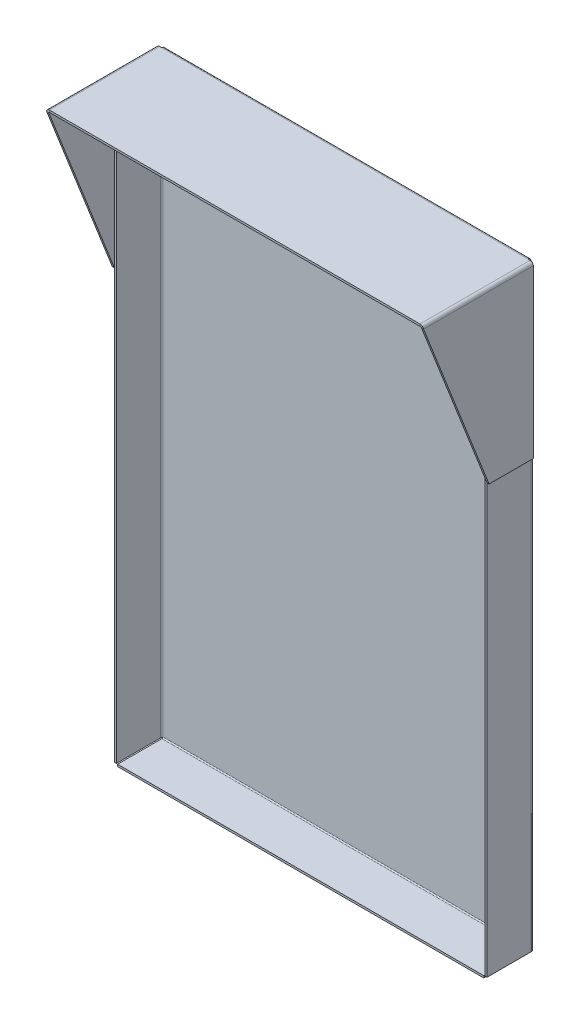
ISO-10303-21;
HEADER;
FILE_DESCRIPTION(('STEP AP214'),'2;1');
FILE_NAME('part.step','',(''),(''),'','','');
FILE_SCHEMA(('AUTOMOTIVE_DESIGN { 1 0 10303 214 1 1 1 1 }'));
ENDSEC;
DATA;
#1=APPLICATION_CONTEXT('core data for automotive mechanical design processes');
#2=APPLICATION_PROTOCOL_DEFINITION('international standard','automotive_design',2000,#1);
#3=PRODUCT_CONTEXT('',#1,'mechanical');
#4=PRODUCT('Part','Part','',(#3));
#5=PRODUCT_RELATED_PRODUCT_CATEGORY('part','',(#4));
#6=PRODUCT_DEFINITION_FORMATION('','',#4);
#7=PRODUCT_DEFINITION_CONTEXT('part definition',#1,'design');
#8=PRODUCT_DEFINITION('design','',#6,#7);
#9=PRODUCT_DEFINITION_SHAPE('','',#8);
#10=(LENGTH_UNIT() NAMED_UNIT(*) SI_UNIT(.MILLI.,.METRE.));
#11=(NAMED_UNIT(*) PLANE_ANGLE_UNIT() SI_UNIT($,.RADIAN.));
#12=(NAMED_UNIT(*) SI_UNIT($,.STERADIAN.) SOLID_ANGLE_UNIT());
#13=UNCERTAINTY_MEASURE_WITH_UNIT(LENGTH_MEASURE(1.E-05),#10,'distance_accuracy_value','');
#14=(GEOMETRIC_REPRESENTATION_CONTEXT(3) GLOBAL_UNCERTAINTY_ASSIGNED_CONTEXT((#13)) GLOBAL_UNIT_ASSIGNED_CONTEXT((#10,
#11,#12)) REPRESENTATION_CONTEXT('',''));
#15=CARTESIAN_POINT('',(0.,0.,0.));
#16=DIRECTION('',(0.,0.,1.));
#17=DIRECTION('',(1.,0.,0.));
#18=AXIS2_PLACEMENT_3D('',#15,#16,#17);
#19=CARTESIAN_POINT('',(83.0072,1.78632097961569E-13,49.88814));
#20=DIRECTION('',(0.,0.,1.));
#21=DIRECTION('',(1.,0.,0.));
#22=AXIS2_PLACEMENT_3D('',#19,#20,#21);
#23=CYLINDRICAL_SURFACE('',#22,1.41985999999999);
#24=DIRECTION('',(0.,0.,1.));
#25=VECTOR('',#24,1.);
#26=CARTESIAN_POINT('',(83.0072,1.41986000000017,49.88814));
#27=LINE('',#26,#25);
#28=CARTESIAN_POINT('',(83.0072,1.41986000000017,49.88814));
#29=VERTEX_POINT('',#28);
#30=CARTESIAN_POINT('',(83.0072,1.41985999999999,0.507999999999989));
#31=VERTEX_POINT('',#30);
#32=EDGE_CURVE('E351',#29,#31,#27,.F.);
#33=ORIENTED_EDGE('',*,*,#32,.F.);
#34=CARTESIAN_POINT('',(83.0072,1.77903190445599E-13,49.6886316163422));
#35=DIRECTION('',(0.,0.139145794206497,-0.990271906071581));
#36=DIRECTION('',(0.,0.990271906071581,0.139145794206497));
#37=AXIS2_PLACEMENT_3D('',#34,#35,#36);
#38=ELLIPSE('',#37,1.43380822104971,1.41985999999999);
#39=CARTESIAN_POINT('',(84.4270600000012,1.80411241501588E-13,49.6886316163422));
#40=VERTEX_POINT('',#39);
#41=EDGE_CURVE('E338',#40,#29,#38,.F.);
#42=ORIENTED_EDGE('',*,*,#41,.F.);
#43=DIRECTION('',(0.,0.,1.));
#44=VECTOR('',#43,1.);
#45=CARTESIAN_POINT('',(84.42706,0.,0.));
#46=LINE('',#45,#44);
#47=CARTESIAN_POINT('',(84.42706,0.,0.507999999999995));
#48=VERTEX_POINT('',#47);
#49=EDGE_CURVE('E755',#48,#40,#46,.T.);
#50=ORIENTED_EDGE('',*,*,#49,.F.);
#51=CARTESIAN_POINT('',(83.0072,0.,0.507999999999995));
#52=DIRECTION('',(0.,0.,1.));
#53=DIRECTION('',(0.,-1.,0.));
#54=AXIS2_PLACEMENT_3D('',#51,#52,#53);
#55=CIRCLE('',#54,1.41985999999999);
#56=EDGE_CURVE('E354',#31,#48,#55,.F.);
#57=ORIENTED_EDGE('',*,*,#56,.F.);
#58=EDGE_LOOP('',(#33,#42,#50,#57));
#59=FACE_BOUND('',#58,.T.);
#60=ADVANCED_FACE('F119',(#59),#23,.T.);
#61=CARTESIAN_POINT('',(83.0072,1.78632097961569E-13,49.88814));
#62=DIRECTION('',(0.,0.,1.));
#63=DIRECTION('',(1.,0.,0.));
#64=AXIS2_PLACEMENT_3D('',#61,#62,#63);
#65=CYLINDRICAL_SURFACE('',#64,0.507999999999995);
#66=CARTESIAN_POINT('',(83.0072,1.77903190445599E-13,49.6886316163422));
#67=DIRECTION('',(0.,0.365552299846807,-0.930790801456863));
#68=DIRECTION('',(0.,0.930790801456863,0.365552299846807));
#69=AXIS2_PLACEMENT_3D('',#66,#67,#68);
#70=ELLIPSE('',#69,0.545772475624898,0.507999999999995);
#71=CARTESIAN_POINT('',(83.5152,1.78655520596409E-13,49.6886316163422));
#72=VERTEX_POINT('',#71);
#73=CARTESIAN_POINT('',(83.0072,0.508000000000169,49.88814));
#74=VERTEX_POINT('',#73);
#75=EDGE_CURVE('E348',#72,#74,#70,.F.);
#76=ORIENTED_EDGE('',*,*,#75,.T.);
#77=DIRECTION('',(0.,0.,1.));
#78=VECTOR('',#77,1.);
#79=CARTESIAN_POINT('',(83.0072,0.508000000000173,49.88814));
#80=LINE('',#79,#78);
#81=CARTESIAN_POINT('',(83.0072,0.507999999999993,0.507999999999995));
#82=VERTEX_POINT('',#81);
#83=EDGE_CURVE('E744',#74,#82,#80,.F.);
#84=ORIENTED_EDGE('',*,*,#83,.T.);
#85=CARTESIAN_POINT('',(83.0072,0.,0.507999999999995));
#86=DIRECTION('',(0.,0.,1.));
#87=DIRECTION('',(0.,-1.,0.));
#88=AXIS2_PLACEMENT_3D('',#85,#86,#87);
#89=CIRCLE('',#88,0.507999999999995);
#90=CARTESIAN_POINT('',(83.5152,0.,0.507999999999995));
#91=VERTEX_POINT('',#90);
#92=EDGE_CURVE('E358',#82,#91,#89,.F.);
#93=ORIENTED_EDGE('',*,*,#92,.T.);
#94=DIRECTION('',(0.,0.,-1.));
#95=VECTOR('',#94,1.);
#96=CARTESIAN_POINT('',(83.5152,0.,0.50800000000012));
#97=LINE('',#96,#95);
#98=EDGE_CURVE('E757',#91,#72,#97,.F.);
#99=ORIENTED_EDGE('',*,*,#98,.T.);
#100=EDGE_LOOP('',(#76,#84,#93,#99));
#101=FACE_BOUND('',#100,.T.);
#102=ADVANCED_FACE('F585',(#101),#65,.F.);
#103=CARTESIAN_POINT('',(84.42706,2.90515423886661E-13,0.));
#104=DIRECTION('',(1.,0.,0.));
#105=DIRECTION('',(0.,1.,0.));
#106=AXIS2_PLACEMENT_3D('',#103,#104,#105);
#107=PLANE('',#106);
#108=ORIENTED_EDGE('',*,*,#49,.T.);
#109=DIRECTION('',(0.,-0.930790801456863,-0.365552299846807));
#110=VECTOR('',#109,1.);
#111=CARTESIAN_POINT('',(84.4270600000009,-74.7801400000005,20.3200000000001));
#112=LINE('',#111,#110);
#113=CARTESIAN_POINT('',(84.4270600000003,-74.7801399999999,20.3200000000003));
#114=VERTEX_POINT('',#113);
#115=EDGE_CURVE('E347',#40,#114,#112,.T.);
#116=ORIENTED_EDGE('',*,*,#115,.T.);
#117=DIRECTION('',(0.,0.,1.));
#118=VECTOR('',#117,1.);
#119=CARTESIAN_POINT('',(84.4270600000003,-74.7801399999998,49.8881400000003));
#120=LINE('',#119,#118);
#121=CARTESIAN_POINT('',(84.4270600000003,-74.78014,0.50800000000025));
#122=VERTEX_POINT('',#121);
#123=EDGE_CURVE('E745',#122,#114,#120,.T.);
#124=ORIENTED_EDGE('',*,*,#123,.F.);
#125=DIRECTION('',(0.,-1.,0.));
#126=VECTOR('',#125,1.);
#127=CARTESIAN_POINT('',(84.4270600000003,-74.78014,0.50800000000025));
#128=LINE('',#127,#126);
#129=EDGE_CURVE('E748',#48,#122,#128,.T.);
#130=ORIENTED_EDGE('',*,*,#129,.F.);
#131=EDGE_LOOP('',(#108,#116,#124,#130));
#132=FACE_BOUND('',#131,.T.);
#133=ADVANCED_FACE('F590',(#132),#107,.T.);
#134=CARTESIAN_POINT('',(83.5152,2.87331681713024E-13,0.));
#135=DIRECTION('',(1.,0.,0.));
#136=DIRECTION('',(0.,1.,0.));
#137=AXIS2_PLACEMENT_3D('',#134,#135,#136);
#138=PLANE('',#137);
#139=DIRECTION('',(0.,-0.930790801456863,-0.365552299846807));
#140=VECTOR('',#139,1.);
#141=CARTESIAN_POINT('',(83.515200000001,-74.7801400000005,20.3200000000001));
#142=LINE('',#141,#140);
#143=CARTESIAN_POINT('',(83.5152000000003,-74.7801399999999,20.3200000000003));
#144=VERTEX_POINT('',#143);
#145=EDGE_CURVE('E136',#72,#144,#142,.T.);
#146=ORIENTED_EDGE('',*,*,#145,.F.);
#147=ORIENTED_EDGE('',*,*,#98,.F.);
#148=DIRECTION('',(0.,1.,0.));
#149=VECTOR('',#148,1.);
#150=CARTESIAN_POINT('',(83.5152,2.89091804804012E-13,0.507999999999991));
#151=LINE('',#150,#149);
#152=CARTESIAN_POINT('',(83.5152000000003,-74.78014,0.50800000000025));
#153=VERTEX_POINT('',#152);
#154=EDGE_CURVE('E753',#91,#153,#151,.F.);
#155=ORIENTED_EDGE('',*,*,#154,.T.);
#156=DIRECTION('',(0.,0.,-1.));
#157=VECTOR('',#156,1.);
#158=CARTESIAN_POINT('',(83.5152000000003,-74.78014,2.73210604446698E-13));
#159=LINE('',#158,#157);
#160=EDGE_CURVE('E750',#153,#144,#159,.F.);
#161=ORIENTED_EDGE('',*,*,#160,.T.);
#162=EDGE_LOOP('',(#146,#147,#155,#161));
#163=FACE_BOUND('',#162,.T.);
#164=ADVANCED_FACE('F1246',(#163),#138,.F.);
#165=CARTESIAN_POINT('',(84.4270600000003,-74.7801399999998,49.8881400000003));
#166=DIRECTION('',(0.,-1.,0.));
#167=DIRECTION('',(0.,0.,-1.));
#168=AXIS2_PLACEMENT_3D('',#165,#166,#167);
#169=PLANE('',#168);
#170=ORIENTED_EDGE('',*,*,#123,.T.);
#171=DIRECTION('',(1.,0.,0.));
#172=VECTOR('',#171,1.);
#173=CARTESIAN_POINT('',(84.4270600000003,-74.7801399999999,20.3200000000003));
#174=LINE('',#173,#172);
#175=EDGE_CURVE('E804',#114,#144,#174,.F.);
#176=ORIENTED_EDGE('',*,*,#175,.T.);
#177=ORIENTED_EDGE('',*,*,#160,.F.);
#178=DIRECTION('',(-1.,0.,0.));
#179=VECTOR('',#178,1.);
#180=CARTESIAN_POINT('',(84.4270600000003,-74.78014,0.50800000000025));
#181=LINE('',#180,#179);
#182=EDGE_CURVE('E741',#122,#153,#181,.T.);
#183=ORIENTED_EDGE('',*,*,#182,.F.);
#184=EDGE_LOOP('',(#170,#176,#177,#183));
#185=FACE_BOUND('',#184,.T.);
#186=ADVANCED_FACE('F1256',(#185),#169,.T.);
#187=CARTESIAN_POINT('',(-83.0072,0.,0.508000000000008));
#188=DIRECTION('',(0.,0.,-1.));
#189=DIRECTION('',(-1.,0.,0.));
#190=AXIS2_PLACEMENT_3D('',#187,#188,#189);
#191=CYLINDRICAL_SURFACE('',#190,1.41986000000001);
#192=DIRECTION('',(0.,0.,-1.));
#193=VECTOR('',#192,1.);
#194=CARTESIAN_POINT('',(-84.42706,1.83604804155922E-13,49.8881400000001));
#195=LINE('',#194,#193);
#196=CARTESIAN_POINT('',(-84.42706,0.,0.50800000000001));
#197=VERTEX_POINT('',#196);
#198=CARTESIAN_POINT('',(-84.42706,1.87074251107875E-13,49.6886316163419));
#199=VERTEX_POINT('',#198);
#200=EDGE_CURVE('E717',#197,#199,#195,.F.);
#201=ORIENTED_EDGE('',*,*,#200,.T.);
#202=CARTESIAN_POINT('',(-83.0072,1.77903190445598E-13,49.6886316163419));
#203=DIRECTION('',(0.,0.139145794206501,-0.990271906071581));
#204=DIRECTION('',(0.,-0.990271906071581,-0.139145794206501));
#205=AXIS2_PLACEMENT_3D('',#202,#203,#204);
#206=ELLIPSE('',#205,1.43380822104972,1.41986000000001);
#207=CARTESIAN_POINT('',(-83.0072,1.41986000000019,49.8881399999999));
#208=VERTEX_POINT('',#207);
#209=EDGE_CURVE('E798',#208,#199,#206,.F.);
#210=ORIENTED_EDGE('',*,*,#209,.F.);
#211=DIRECTION('',(0.,0.,-1.));
#212=VECTOR('',#211,1.);
#213=CARTESIAN_POINT('',(-83.0072,1.41986000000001,0.508000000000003));
#214=LINE('',#213,#212);
#215=CARTESIAN_POINT('',(-83.0072,1.41986000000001,0.508000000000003));
#216=VERTEX_POINT('',#215);
#217=EDGE_CURVE('E365',#216,#208,#214,.F.);
#218=ORIENTED_EDGE('',*,*,#217,.F.);
#219=CARTESIAN_POINT('',(-83.0072,0.,0.508000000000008));
#220=DIRECTION('',(0.,0.,-1.));
#221=DIRECTION('',(0.,1.,0.));
#222=AXIS2_PLACEMENT_3D('',#219,#220,#221);
#223=CIRCLE('',#222,1.41986000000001);
#224=EDGE_CURVE('E728',#197,#216,#223,.T.);
#225=ORIENTED_EDGE('',*,*,#224,.F.);
#226=EDGE_LOOP('',(#201,#210,#218,#225));
#227=FACE_BOUND('',#226,.T.);
#228=ADVANCED_FACE('F797',(#227),#191,.T.);
#229=CARTESIAN_POINT('',(-83.0072,0.,0.508000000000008));
#230=DIRECTION('',(0.,0.,-1.));
#231=DIRECTION('',(-1.,0.,0.));
#232=AXIS2_PLACEMENT_3D('',#229,#230,#231);
#233=CYLINDRICAL_SURFACE('',#232,0.508000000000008);
#234=CARTESIAN_POINT('',(-83.0072,1.77903190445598E-13,49.6886316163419));
#235=DIRECTION('',(0.,0.365552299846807,-0.930790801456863));
#236=DIRECTION('',(0.,-0.930790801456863,-0.365552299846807));
#237=AXIS2_PLACEMENT_3D('',#234,#235,#236);
#238=ELLIPSE('',#237,0.545772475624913,0.508000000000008);
#239=CARTESIAN_POINT('',(-83.0072,0.508000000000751,49.8881399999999));
#240=VERTEX_POINT('',#239);
#241=CARTESIAN_POINT('',(-83.5152,1.83880688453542E-13,49.6886316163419));
#242=VERTEX_POINT('',#241);
#243=EDGE_CURVE('E779',#240,#242,#238,.F.);
#244=ORIENTED_EDGE('',*,*,#243,.T.);
#245=DIRECTION('',(0.,0.,-1.));
#246=VECTOR('',#245,1.);
#247=CARTESIAN_POINT('',(-83.5152,1.80411241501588E-13,49.8881400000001));
#248=LINE('',#247,#246);
#249=CARTESIAN_POINT('',(-83.5152,0.,0.508000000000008));
#250=VERTEX_POINT('',#249);
#251=EDGE_CURVE('E723',#242,#250,#248,.T.);
#252=ORIENTED_EDGE('',*,*,#251,.T.);
#253=CARTESIAN_POINT('',(-83.0072,0.,0.508000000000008));
#254=DIRECTION('',(0.,0.,-1.));
#255=DIRECTION('',(0.,1.,0.));
#256=AXIS2_PLACEMENT_3D('',#253,#254,#255);
#257=CIRCLE('',#256,0.508000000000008);
#258=CARTESIAN_POINT('',(-83.0072,0.508000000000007,0.508000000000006));
#259=VERTEX_POINT('',#258);
#260=EDGE_CURVE('E706',#250,#259,#257,.T.);
#261=ORIENTED_EDGE('',*,*,#260,.T.);
#262=DIRECTION('',(0.,0.,-1.));
#263=VECTOR('',#262,1.);
#264=CARTESIAN_POINT('',(-83.0072,0.508000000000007,0.508000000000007));
#265=LINE('',#264,#263);
#266=EDGE_CURVE('E731',#259,#240,#265,.F.);
#267=ORIENTED_EDGE('',*,*,#266,.T.);
#268=EDGE_LOOP('',(#244,#252,#261,#267));
#269=FACE_BOUND('',#268,.T.);
#270=ADVANCED_FACE('F777',(#269),#233,.F.);
#271=CARTESIAN_POINT('',(-84.42706,2.90515423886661E-13,0.));
#272=DIRECTION('',(1.,0.,0.));
#273=DIRECTION('',(0.,1.,0.));
#274=AXIS2_PLACEMENT_3D('',#271,#272,#273);
#275=PLANE('',#274);
#276=DIRECTION('',(0.,0.930790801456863,0.365552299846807));
#277=VECTOR('',#276,1.);
#278=CARTESIAN_POINT('',(-84.4270600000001,-16.9066919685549,43.0488151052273));
#279=LINE('',#278,#277);
#280=CARTESIAN_POINT('',(-84.4270600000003,-74.7801399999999,20.32));
#281=VERTEX_POINT('',#280);
#282=EDGE_CURVE('E144',#281,#199,#279,.T.);
#283=ORIENTED_EDGE('',*,*,#282,.T.);
#284=ORIENTED_EDGE('',*,*,#200,.F.);
#285=DIRECTION('',(0.,-1.,0.));
#286=VECTOR('',#285,1.);
#287=CARTESIAN_POINT('',(-84.4270600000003,-74.78014,0.508000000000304));
#288=LINE('',#287,#286);
#289=CARTESIAN_POINT('',(-84.4270600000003,-74.78014,0.508000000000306));
#290=VERTEX_POINT('',#289);
#291=EDGE_CURVE('E707',#290,#197,#288,.F.);
#292=ORIENTED_EDGE('',*,*,#291,.F.);
#293=DIRECTION('',(0.,0.,1.));
#294=VECTOR('',#293,1.);
#295=CARTESIAN_POINT('',(-84.4270600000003,-74.7801399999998,49.8881400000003));
#296=LINE('',#295,#294);
#297=EDGE_CURVE('E710',#281,#290,#296,.F.);
#298=ORIENTED_EDGE('',*,*,#297,.F.);
#299=EDGE_LOOP('',(#283,#284,#292,#298));
#300=FACE_BOUND('',#299,.T.);
#301=ADVANCED_FACE('F793',(#300),#275,.F.);
#302=CARTESIAN_POINT('',(-83.5152,2.87331681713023E-13,0.));
#303=DIRECTION('',(1.,0.,0.));
#304=DIRECTION('',(0.,1.,0.));
#305=AXIS2_PLACEMENT_3D('',#302,#303,#304);
#306=PLANE('',#305);
#307=ORIENTED_EDGE('',*,*,#251,.F.);
#308=DIRECTION('',(0.,0.930790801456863,0.365552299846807));
#309=VECTOR('',#308,1.);
#310=CARTESIAN_POINT('',(-83.5152000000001,-16.9066919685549,43.0488151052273));
#311=LINE('',#310,#309);
#312=CARTESIAN_POINT('',(-83.5152000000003,-74.7801399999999,20.32));
#313=VERTEX_POINT('',#312);
#314=EDGE_CURVE('E784',#313,#242,#311,.T.);
#315=ORIENTED_EDGE('',*,*,#314,.F.);
#316=DIRECTION('',(0.,0.,-1.));
#317=VECTOR('',#316,1.);
#318=CARTESIAN_POINT('',(-83.5152000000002,-74.78014,2.26268403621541E-13));
#319=LINE('',#318,#317);
#320=CARTESIAN_POINT('',(-83.5152000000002,-74.78014,0.508000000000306));
#321=VERTEX_POINT('',#320);
#322=EDGE_CURVE('E715',#313,#321,#319,.T.);
#323=ORIENTED_EDGE('',*,*,#322,.T.);
#324=DIRECTION('',(0.,1.,0.));
#325=VECTOR('',#324,1.);
#326=CARTESIAN_POINT('',(-83.5152,2.89345654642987E-13,0.508000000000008));
#327=LINE('',#326,#325);
#328=EDGE_CURVE('E712',#321,#250,#327,.T.);
#329=ORIENTED_EDGE('',*,*,#328,.T.);
#330=EDGE_LOOP('',(#307,#315,#323,#329));
#331=FACE_BOUND('',#330,.T.);
#332=ADVANCED_FACE('F782',(#331),#306,.T.);
#333=CARTESIAN_POINT('',(-84.4270600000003,-74.7801399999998,49.8881400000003));
#334=DIRECTION('',(0.,-1.,0.));
#335=DIRECTION('',(0.,0.,-1.));
#336=AXIS2_PLACEMENT_3D('',#333,#334,#335);
#337=PLANE('',#336);
#338=ORIENTED_EDGE('',*,*,#322,.F.);
#339=DIRECTION('',(1.,0.,0.));
#340=VECTOR('',#339,1.);
#341=CARTESIAN_POINT('',(-83.5152000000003,-74.7801399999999,20.32));
#342=LINE('',#341,#340);
#343=EDGE_CURVE('E807',#313,#281,#342,.F.);
#344=ORIENTED_EDGE('',*,*,#343,.T.);
#345=ORIENTED_EDGE('',*,*,#297,.T.);
#346=DIRECTION('',(1.,0.,0.));
#347=VECTOR('',#346,1.);
#348=CARTESIAN_POINT('',(-84.4270600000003,-74.78014,0.508000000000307));
#349=LINE('',#348,#347);
#350=EDGE_CURVE('E703',#290,#321,#349,.T.);
#351=ORIENTED_EDGE('',*,*,#350,.T.);
#352=EDGE_LOOP('',(#338,#344,#345,#351));
#353=FACE_BOUND('',#352,.T.);
#354=ADVANCED_FACE('F1008',(#353),#337,.T.);
#355=CARTESIAN_POINT('',(82.042,-266.7,0.));
#356=DIRECTION('',(-1.,0.,0.));
#357=DIRECTION('',(0.,-1.,0.));
#358=AXIS2_PLACEMENT_3D('',#355,#356,#357);
#359=PLANE('',#358);
#360=DIRECTION('',(0.,0.,1.));
#361=VECTOR('',#360,1.);
#362=CARTESIAN_POINT('',(82.042,-266.7,-0.91186));
#363=LINE('',#362,#361);
#364=CARTESIAN_POINT('',(82.042,-266.7,-0.91186));
#365=VERTEX_POINT('',#364);
#366=CARTESIAN_POINT('',(82.042,-266.7,-0.837097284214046));
#367=VERTEX_POINT('',#366);
#368=EDGE_CURVE('E527',#365,#367,#363,.T.);
#369=ORIENTED_EDGE('',*,*,#368,.T.);
#370=CARTESIAN_POINT('',(82.042,-266.24534,0.50800000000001));
#371=DIRECTION('',(1.,0.,0.));
#372=DIRECTION('',(0.,0.,-1.));
#373=AXIS2_PLACEMENT_3D('',#370,#371,#372);
#374=CIRCLE('',#373,1.41986000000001);
#375=CARTESIAN_POINT('',(82.042,-266.24534,-0.911859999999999));
#376=VERTEX_POINT('',#375);
#377=EDGE_CURVE('E13',#367,#376,#374,.T.);
#378=ORIENTED_EDGE('',*,*,#377,.T.);
#379=DIRECTION('',(0.,1.,0.));
#380=VECTOR('',#379,1.);
#381=CARTESIAN_POINT('',(82.042,-266.7,-0.91186));
#382=LINE('',#381,#380);
#383=EDGE_CURVE('E502',#365,#376,#382,.T.);
#384=ORIENTED_EDGE('',*,*,#383,.F.);
#385=EDGE_LOOP('',(#369,#378,#384));
#386=FACE_BOUND('',#385,.T.);
#387=ADVANCED_FACE('F1003',(#386),#359,.T.);
#388=CARTESIAN_POINT('',(-82.042,-266.24534,0.));
#389=DIRECTION('',(1.,0.,0.));
#390=DIRECTION('',(0.,0.,-1.));
#391=AXIS2_PLACEMENT_3D('',#388,#389,#390);
#392=PLANE('',#391);
#393=DIRECTION('',(0.,1.,0.));
#394=VECTOR('',#393,1.);
#395=CARTESIAN_POINT('',(-82.042,-266.7,-0.91185999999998));
#396=LINE('',#395,#394);
#397=CARTESIAN_POINT('',(-82.042,-266.7,-0.91185999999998));
#398=VERTEX_POINT('',#397);
#399=CARTESIAN_POINT('',(-82.042,-266.24534,-0.911859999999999));
#400=VERTEX_POINT('',#399);
#401=EDGE_CURVE('E498',#398,#400,#396,.T.);
#402=ORIENTED_EDGE('',*,*,#401,.T.);
#403=CARTESIAN_POINT('',(-82.042,-266.24534,0.50800000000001));
#404=DIRECTION('',(1.,0.,0.));
#405=DIRECTION('',(0.,0.,-1.));
#406=AXIS2_PLACEMENT_3D('',#403,#404,#405);
#407=CIRCLE('',#406,1.41986000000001);
#408=CARTESIAN_POINT('',(-82.042,-266.7,-0.837097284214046));
#409=VERTEX_POINT('',#408);
#410=EDGE_CURVE('E725',#400,#409,#407,.F.);
#411=ORIENTED_EDGE('',*,*,#410,.T.);
#412=DIRECTION('',(0.,0.,-1.));
#413=VECTOR('',#412,1.);
#414=CARTESIAN_POINT('',(-82.042,-266.7,0.));
#415=LINE('',#414,#413);
#416=EDGE_CURVE('E519',#409,#398,#415,.T.);
#417=ORIENTED_EDGE('',*,*,#416,.T.);
#418=EDGE_LOOP('',(#402,#411,#417));
#419=FACE_BOUND('',#418,.T.);
#420=ADVANCED_FACE('F645',(#419),#392,.T.);
#421=CARTESIAN_POINT('',(82.55,-266.7,0.));
#422=DIRECTION('',(0.,0.,1.));
#423=DIRECTION('',(1.,0.,0.));
#424=AXIS2_PLACEMENT_3D('',#421,#422,#423);
#425=PLANE('',#424);
#426=DIRECTION('',(0.,1.,0.));
#427=VECTOR('',#426,1.);
#428=CARTESIAN_POINT('',(-82.042,-266.7,0.));
#429=LINE('',#428,#427);
#430=CARTESIAN_POINT('',(-82.042,-266.24534,0.));
#431=VERTEX_POINT('',#430);
#432=CARTESIAN_POINT('',(-82.042,0.,0.));
#433=VERTEX_POINT('',#432);
#434=EDGE_CURVE('E486',#431,#433,#429,.T.);
#435=ORIENTED_EDGE('',*,*,#434,.F.);
#436=DIRECTION('',(1.,0.,0.));
#437=VECTOR('',#436,1.);
#438=CARTESIAN_POINT('',(82.042,-266.24534,0.));
#439=LINE('',#438,#437);
#440=CARTESIAN_POINT('',(82.042,-266.24534,0.));
#441=VERTEX_POINT('',#440);
#442=EDGE_CURVE('E693',#441,#431,#439,.F.);
#443=ORIENTED_EDGE('',*,*,#442,.F.);
#444=DIRECTION('',(0.,1.,0.));
#445=VECTOR('',#444,1.);
#446=CARTESIAN_POINT('',(82.042,-266.7,0.));
#447=LINE('',#446,#445);
#448=CARTESIAN_POINT('',(82.042,0.,0.));
#449=VERTEX_POINT('',#448);
#450=EDGE_CURVE('E482',#441,#449,#447,.T.);
#451=ORIENTED_EDGE('',*,*,#450,.T.);
#452=DIRECTION('',(1.,0.,0.));
#453=VECTOR('',#452,1.);
#454=CARTESIAN_POINT('',(82.55,0.,0.));
#455=LINE('',#454,#453);
#456=EDGE_CURVE('E471',#433,#449,#455,.T.);
#457=ORIENTED_EDGE('',*,*,#456,.F.);
#458=EDGE_LOOP('',(#435,#443,#451,#457));
#459=FACE_BOUND('',#458,.T.);
#460=ADVANCED_FACE('F641',(#459),#425,.T.);
#461=CARTESIAN_POINT('',(82.55,-266.7,-0.91186));
#462=DIRECTION('',(0.,0.,1.));
#463=DIRECTION('',(1.,0.,0.));
#464=AXIS2_PLACEMENT_3D('',#461,#462,#463);
#465=PLANE('',#464);
#466=DIRECTION('',(1.,0.,0.));
#467=VECTOR('',#466,1.);
#468=CARTESIAN_POINT('',(82.042,-266.24534,-0.911859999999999));
#469=LINE('',#468,#467);
#470=EDGE_CURVE('E671',#376,#400,#469,.F.);
#471=ORIENTED_EDGE('',*,*,#470,.T.);
#472=CARTESIAN_POINT('',(-82.042,0.,-0.911859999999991));
#473=VERTEX_POINT('',#472);
#474=EDGE_CURVE('E501',#400,#473,#396,.T.);
#475=ORIENTED_EDGE('',*,*,#474,.T.);
#476=DIRECTION('',(1.,0.,0.));
#477=VECTOR('',#476,1.);
#478=CARTESIAN_POINT('',(82.55,0.,-0.91186));
#479=LINE('',#478,#477);
#480=CARTESIAN_POINT('',(82.042,0.,-0.91186));
#481=VERTEX_POINT('',#480);
#482=EDGE_CURVE('E454',#473,#481,#479,.T.);
#483=ORIENTED_EDGE('',*,*,#482,.T.);
#484=EDGE_CURVE('E505',#376,#481,#382,.T.);
#485=ORIENTED_EDGE('',*,*,#484,.F.);
#486=EDGE_LOOP('',(#471,#475,#483,#485));
#487=FACE_BOUND('',#486,.T.);
#488=ADVANCED_FACE('F644',(#487),#465,.F.);
#489=CARTESIAN_POINT('',(82.55,-266.7,0.508));
#490=DIRECTION('',(0.,-1.,0.));
#491=DIRECTION('',(0.,0.,-1.));
#492=AXIS2_PLACEMENT_3D('',#489,#490,#491);
#493=PLANE('',#492);
#494=DIRECTION('',(1.,0.,0.));
#495=VECTOR('',#494,1.);
#496=CARTESIAN_POINT('',(82.55,-266.7,0.508));
#497=LINE('',#496,#495);
#498=CARTESIAN_POINT('',(82.55,-266.7,0.508));
#499=VERTEX_POINT('',#498);
#500=CARTESIAN_POINT('',(83.46186,-266.7,0.508));
#501=VERTEX_POINT('',#500);
#502=EDGE_CURVE('E123',#499,#501,#497,.T.);
#503=ORIENTED_EDGE('',*,*,#502,.F.);
#504=CARTESIAN_POINT('',(82.042,-266.7,0.508));
#505=DIRECTION('',(0.,-1.,0.));
#506=DIRECTION('',(0.,0.,-1.));
#507=AXIS2_PLACEMENT_3D('',#504,#505,#506);
#508=CIRCLE('',#507,0.508);
#509=CARTESIAN_POINT('',(82.042,-266.7,0.));
#510=VERTEX_POINT('',#509);
#511=EDGE_CURVE('E440',#510,#499,#508,.T.);
#512=ORIENTED_EDGE('',*,*,#511,.F.);
#513=EDGE_CURVE('E526',#367,#510,#363,.T.);
#514=ORIENTED_EDGE('',*,*,#513,.F.);
#515=ORIENTED_EDGE('',*,*,#368,.F.);
#516=CARTESIAN_POINT('',(82.042,-266.7,0.508));
#517=DIRECTION('',(0.,1.,0.));
#518=DIRECTION('',(1.,0.,0.));
#519=AXIS2_PLACEMENT_3D('',#516,#517,#518);
#520=CIRCLE('',#519,1.41986);
#521=EDGE_CURVE('E423',#365,#501,#520,.F.);
#522=ORIENTED_EDGE('',*,*,#521,.T.);
#523=EDGE_LOOP('',(#503,#512,#514,#515,#522));
#524=FACE_BOUND('',#523,.T.);
#525=ADVANCED_FACE('F121',(#524),#493,.T.);
#526=CARTESIAN_POINT('',(82.042,-266.7,-0.91186));
#527=DIRECTION('',(0.,-1.,0.));
#528=DIRECTION('',(0.,0.,-1.));
#529=AXIS2_PLACEMENT_3D('',#526,#527,#528);
#530=PLANE('',#529);
#531=DIRECTION('',(0.,0.,1.));
#532=VECTOR('',#531,1.);
#533=CARTESIAN_POINT('',(82.55,-266.7,0.));
#534=LINE('',#533,#532);
#535=CARTESIAN_POINT('',(82.55,-266.7,20.32));
#536=VERTEX_POINT('',#535);
#537=EDGE_CURVE('E415',#499,#536,#534,.T.);
#538=ORIENTED_EDGE('',*,*,#537,.F.);
#539=ORIENTED_EDGE('',*,*,#502,.T.);
#540=DIRECTION('',(0.,0.,-1.));
#541=VECTOR('',#540,1.);
#542=CARTESIAN_POINT('',(83.46186,-266.7,0.));
#543=LINE('',#542,#541);
#544=CARTESIAN_POINT('',(83.46186,-266.7,20.32));
#545=VERTEX_POINT('',#544);
#546=EDGE_CURVE('E421',#501,#545,#543,.F.);
#547=ORIENTED_EDGE('',*,*,#546,.T.);
#548=DIRECTION('',(-1.,0.,0.));
#549=VECTOR('',#548,1.);
#550=CARTESIAN_POINT('',(83.46186,-266.7,20.32));
#551=LINE('',#550,#549);
#552=EDGE_CURVE('E418',#545,#536,#551,.T.);
#553=ORIENTED_EDGE('',*,*,#552,.T.);
#554=EDGE_LOOP('',(#538,#539,#547,#553));
#555=FACE_BOUND('',#554,.T.);
#556=ADVANCED_FACE('F553',(#555),#530,.T.);
#557=CARTESIAN_POINT('',(82.042,0.,0.));
#558=DIRECTION('',(0.,1.,0.));
#559=DIRECTION('',(0.,0.,1.));
#560=AXIS2_PLACEMENT_3D('',#557,#558,#559);
#561=PLANE('',#560);
#562=DIRECTION('',(0.,0.,-1.));
#563=VECTOR('',#562,1.);
#564=CARTESIAN_POINT('',(82.042,0.,0.));
#565=LINE('',#564,#563);
#566=EDGE_CURVE('E524',#449,#481,#565,.T.);
#567=ORIENTED_EDGE('',*,*,#566,.F.);
#568=CARTESIAN_POINT('',(82.042,0.,0.508));
#569=DIRECTION('',(0.,-1.,0.));
#570=DIRECTION('',(0.,0.,-1.));
#571=AXIS2_PLACEMENT_3D('',#568,#569,#570);
#572=CIRCLE('',#571,0.508);
#573=CARTESIAN_POINT('',(82.55,0.,0.508));
#574=VERTEX_POINT('',#573);
#575=EDGE_CURVE('E419',#449,#574,#572,.T.);
#576=ORIENTED_EDGE('',*,*,#575,.T.);
#577=DIRECTION('',(-1.,0.,0.));
#578=VECTOR('',#577,1.);
#579=CARTESIAN_POINT('',(83.46186,0.,0.508));
#580=LINE('',#579,#578);
#581=CARTESIAN_POINT('',(83.46186,0.,0.508));
#582=VERTEX_POINT('',#581);
#583=EDGE_CURVE('E522',#582,#574,#580,.T.);
#584=ORIENTED_EDGE('',*,*,#583,.F.);
#585=CARTESIAN_POINT('',(82.042,0.,0.508));
#586=DIRECTION('',(0.,1.,0.));
#587=DIRECTION('',(1.,0.,0.));
#588=AXIS2_PLACEMENT_3D('',#585,#586,#587);
#589=CIRCLE('',#588,1.41986);
#590=EDGE_CURVE('E451',#481,#582,#589,.F.);
#591=ORIENTED_EDGE('',*,*,#590,.F.);
#592=EDGE_LOOP('',(#567,#576,#584,#591));
#593=FACE_BOUND('',#592,.T.);
#594=ADVANCED_FACE('F567',(#593),#561,.T.);
#595=CARTESIAN_POINT('',(-82.042,-266.7,0.));
#596=DIRECTION('',(0.,-1.,0.));
#597=DIRECTION('',(0.,0.,-1.));
#598=AXIS2_PLACEMENT_3D('',#595,#596,#597);
#599=PLANE('',#598);
#600=CARTESIAN_POINT('',(-82.042,-266.7,0.));
#601=VERTEX_POINT('',#600);
#602=EDGE_CURVE('E520',#601,#409,#415,.T.);
#603=ORIENTED_EDGE('',*,*,#602,.F.);
#604=CARTESIAN_POINT('',(-82.042,-266.7,0.50800000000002));
#605=DIRECTION('',(0.,-1.,0.));
#606=DIRECTION('',(0.,0.,-1.));
#607=AXIS2_PLACEMENT_3D('',#604,#605,#606);
#608=CIRCLE('',#607,0.508);
#609=CARTESIAN_POINT('',(-82.55,-266.7,0.50800000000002));
#610=VERTEX_POINT('',#609);
#611=EDGE_CURVE('E437',#610,#601,#608,.T.);
#612=ORIENTED_EDGE('',*,*,#611,.F.);
#613=DIRECTION('',(1.,0.,0.));
#614=VECTOR('',#613,1.);
#615=CARTESIAN_POINT('',(-83.46186,-266.7,0.50800000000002));
#616=LINE('',#615,#614);
#617=CARTESIAN_POINT('',(-83.46186,-266.7,0.50800000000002));
#618=VERTEX_POINT('',#617);
#619=EDGE_CURVE('E517',#618,#610,#616,.T.);
#620=ORIENTED_EDGE('',*,*,#619,.F.);
#621=CARTESIAN_POINT('',(-82.042,-266.7,0.50800000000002));
#622=DIRECTION('',(0.,1.,0.));
#623=DIRECTION('',(1.,0.,0.));
#624=AXIS2_PLACEMENT_3D('',#621,#622,#623);
#625=CIRCLE('',#624,1.41986);
#626=EDGE_CURVE('E426',#618,#398,#625,.F.);
#627=ORIENTED_EDGE('',*,*,#626,.T.);
#628=ORIENTED_EDGE('',*,*,#416,.F.);
#629=EDGE_LOOP('',(#603,#612,#620,#627,#628));
#630=FACE_BOUND('',#629,.T.);
#631=ADVANCED_FACE('F873',(#630),#599,.T.);
#632=CARTESIAN_POINT('',(-82.55,0.,0.50800000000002));
#633=DIRECTION('',(0.,1.,0.));
#634=DIRECTION('',(0.,0.,1.));
#635=AXIS2_PLACEMENT_3D('',#632,#633,#634);
#636=PLANE('',#635);
#637=DIRECTION('',(-1.,0.,0.));
#638=VECTOR('',#637,1.);
#639=CARTESIAN_POINT('',(-82.55,0.,0.50800000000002));
#640=LINE('',#639,#638);
#641=CARTESIAN_POINT('',(-82.55,0.,0.50800000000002));
#642=VERTEX_POINT('',#641);
#643=CARTESIAN_POINT('',(-83.46186,0.,0.50800000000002));
#644=VERTEX_POINT('',#643);
#645=EDGE_CURVE('E515',#642,#644,#640,.T.);
#646=ORIENTED_EDGE('',*,*,#645,.F.);
#647=CARTESIAN_POINT('',(-82.042,0.,0.50800000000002));
#648=DIRECTION('',(0.,-1.,0.));
#649=DIRECTION('',(0.,0.,-1.));
#650=AXIS2_PLACEMENT_3D('',#647,#648,#649);
#651=CIRCLE('',#650,0.508);
#652=EDGE_CURVE('E468',#642,#433,#651,.T.);
#653=ORIENTED_EDGE('',*,*,#652,.T.);
#654=DIRECTION('',(0.,0.,1.));
#655=VECTOR('',#654,1.);
#656=CARTESIAN_POINT('',(-82.042,0.,-0.91185999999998));
#657=LINE('',#656,#655);
#658=EDGE_CURVE('E479',#473,#433,#657,.T.);
#659=ORIENTED_EDGE('',*,*,#658,.F.);
#660=CARTESIAN_POINT('',(-82.042,0.,0.50800000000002));
#661=DIRECTION('',(0.,1.,0.));
#662=DIRECTION('',(1.,0.,0.));
#663=AXIS2_PLACEMENT_3D('',#660,#661,#662);
#664=CIRCLE('',#663,1.41986);
#665=EDGE_CURVE('E457',#644,#473,#664,.F.);
#666=ORIENTED_EDGE('',*,*,#665,.F.);
#667=EDGE_LOOP('',(#646,#653,#659,#666));
#668=FACE_BOUND('',#667,.T.);
#669=ADVANCED_FACE('F683',(#668),#636,.T.);
#670=CARTESIAN_POINT('',(-82.042,0.,-0.91185999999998));
#671=DIRECTION('',(0.,1.,0.));
#672=DIRECTION('',(0.,0.,1.));
#673=AXIS2_PLACEMENT_3D('',#670,#671,#672);
#674=PLANE('',#673);
#675=DIRECTION('',(0.,0.,-1.));
#676=VECTOR('',#675,1.);
#677=CARTESIAN_POINT('',(-82.55,0.,0.));
#678=LINE('',#677,#676);
#679=CARTESIAN_POINT('',(-82.55,0.,20.32));
#680=VERTEX_POINT('',#679);
#681=EDGE_CURVE('E465',#680,#642,#678,.T.);
#682=ORIENTED_EDGE('',*,*,#681,.T.);
#683=ORIENTED_EDGE('',*,*,#645,.T.);
#684=DIRECTION('',(0.,0.,-1.));
#685=VECTOR('',#684,1.);
#686=CARTESIAN_POINT('',(-83.46186,0.,0.));
#687=LINE('',#686,#685);
#688=CARTESIAN_POINT('',(-83.46186,0.,20.32));
#689=VERTEX_POINT('',#688);
#690=EDGE_CURVE('E460',#689,#644,#687,.T.);
#691=ORIENTED_EDGE('',*,*,#690,.F.);
#692=DIRECTION('',(-1.,0.,0.));
#693=VECTOR('',#692,1.);
#694=CARTESIAN_POINT('',(-82.55,0.,20.32));
#695=LINE('',#694,#693);
#696=EDGE_CURVE('E463',#680,#689,#695,.T.);
#697=ORIENTED_EDGE('',*,*,#696,.F.);
#698=EDGE_LOOP('',(#682,#683,#691,#697));
#699=FACE_BOUND('',#698,.T.);
#700=ADVANCED_FACE('F883',(#699),#674,.T.);
#701=CARTESIAN_POINT('',(82.55,-266.7,0.));
#702=DIRECTION('',(-1.,0.,0.));
#703=DIRECTION('',(0.,0.,1.));
#704=AXIS2_PLACEMENT_3D('',#701,#702,#703);
#705=PLANE('',#704);
#706=DIRECTION('',(0.,0.,1.));
#707=VECTOR('',#706,1.);
#708=CARTESIAN_POINT('',(82.55,0.,0.));
#709=LINE('',#708,#707);
#710=CARTESIAN_POINT('',(82.55,0.,20.32));
#711=VERTEX_POINT('',#710);
#712=EDGE_CURVE('E406',#574,#711,#709,.T.);
#713=ORIENTED_EDGE('',*,*,#712,.F.);
#714=DIRECTION('',(0.,1.,0.));
#715=VECTOR('',#714,1.);
#716=CARTESIAN_POINT('',(82.55,-266.7,0.508));
#717=LINE('',#716,#715);
#718=EDGE_CURVE('E476',#499,#574,#717,.T.);
#719=ORIENTED_EDGE('',*,*,#718,.F.);
#720=ORIENTED_EDGE('',*,*,#537,.T.);
#721=DIRECTION('',(0.,1.,0.));
#722=VECTOR('',#721,1.);
#723=CARTESIAN_POINT('',(82.55,-266.7,20.32));
#724=LINE('',#723,#722);
#725=EDGE_CURVE('E443',#536,#711,#724,.T.);
#726=ORIENTED_EDGE('',*,*,#725,.T.);
#727=EDGE_LOOP('',(#713,#719,#720,#726));
#728=FACE_BOUND('',#727,.T.);
#729=ADVANCED_FACE('F552',(#728),#705,.T.);
#730=CARTESIAN_POINT('',(82.042,-266.7,0.508));
#731=DIRECTION('',(0.,1.,0.));
#732=DIRECTION('',(0.,0.,1.));
#733=AXIS2_PLACEMENT_3D('',#730,#731,#732);
#734=CYLINDRICAL_SURFACE('',#733,0.508);
#735=ORIENTED_EDGE('',*,*,#575,.F.);
#736=ORIENTED_EDGE('',*,*,#450,.F.);
#737=EDGE_CURVE('E480',#510,#441,#447,.T.);
#738=ORIENTED_EDGE('',*,*,#737,.F.);
#739=ORIENTED_EDGE('',*,*,#511,.T.);
#740=ORIENTED_EDGE('',*,*,#718,.T.);
#741=EDGE_LOOP('',(#735,#736,#738,#739,#740));
#742=FACE_BOUND('',#741,.T.);
#743=ADVANCED_FACE('F544',(#742),#734,.F.);
#744=CARTESIAN_POINT('',(-82.042,-266.7,0.50800000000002));
#745=DIRECTION('',(0.,1.,0.));
#746=DIRECTION('',(0.,0.,1.));
#747=AXIS2_PLACEMENT_3D('',#744,#745,#746);
#748=CYLINDRICAL_SURFACE('',#747,0.508);
#749=ORIENTED_EDGE('',*,*,#652,.F.);
#750=DIRECTION('',(0.,1.,0.));
#751=VECTOR('',#750,1.);
#752=CARTESIAN_POINT('',(-82.55,-266.7,0.50800000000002));
#753=LINE('',#752,#751);
#754=EDGE_CURVE('E487',#610,#642,#753,.T.);
#755=ORIENTED_EDGE('',*,*,#754,.F.);
#756=ORIENTED_EDGE('',*,*,#611,.T.);
#757=EDGE_CURVE('E483',#601,#431,#429,.T.);
#758=ORIENTED_EDGE('',*,*,#757,.T.);
#759=ORIENTED_EDGE('',*,*,#434,.T.);
#760=EDGE_LOOP('',(#749,#755,#756,#758,#759));
#761=FACE_BOUND('',#760,.T.);
#762=ADVANCED_FACE('F640',(#761),#748,.F.);
#763=CARTESIAN_POINT('',(-82.55,-266.7,0.));
#764=DIRECTION('',(1.,0.,0.));
#765=DIRECTION('',(0.,0.,-1.));
#766=AXIS2_PLACEMENT_3D('',#763,#764,#765);
#767=PLANE('',#766);
#768=ORIENTED_EDGE('',*,*,#681,.F.);
#769=DIRECTION('',(0.,1.,0.));
#770=VECTOR('',#769,1.);
#771=CARTESIAN_POINT('',(-82.55,-266.7,20.32));
#772=LINE('',#771,#770);
#773=CARTESIAN_POINT('',(-82.55,-266.7,20.32));
#774=VERTEX_POINT('',#773);
#775=EDGE_CURVE('E490',#774,#680,#772,.T.);
#776=ORIENTED_EDGE('',*,*,#775,.F.);
#777=DIRECTION('',(0.,0.,-1.));
#778=VECTOR('',#777,1.);
#779=CARTESIAN_POINT('',(-82.55,-266.7,0.));
#780=LINE('',#779,#778);
#781=EDGE_CURVE('E434',#774,#610,#780,.T.);
#782=ORIENTED_EDGE('',*,*,#781,.T.);
#783=ORIENTED_EDGE('',*,*,#754,.T.);
#784=EDGE_LOOP('',(#768,#776,#782,#783));
#785=FACE_BOUND('',#784,.T.);
#786=ADVANCED_FACE('F649',(#785),#767,.T.);
#787=CARTESIAN_POINT('',(-82.55,-266.7,20.32));
#788=DIRECTION('',(0.,0.,-1.));
#789=DIRECTION('',(-1.,0.,0.));
#790=AXIS2_PLACEMENT_3D('',#787,#788,#789);
#791=PLANE('',#790);
#792=ORIENTED_EDGE('',*,*,#696,.T.);
#793=DIRECTION('',(0.,1.,0.));
#794=VECTOR('',#793,1.);
#795=CARTESIAN_POINT('',(-83.46186,-266.7,20.32));
#796=LINE('',#795,#794);
#797=CARTESIAN_POINT('',(-83.46186,-266.7,20.32));
#798=VERTEX_POINT('',#797);
#799=EDGE_CURVE('E492',#798,#689,#796,.T.);
#800=ORIENTED_EDGE('',*,*,#799,.F.);
#801=DIRECTION('',(-1.,0.,0.));
#802=VECTOR('',#801,1.);
#803=CARTESIAN_POINT('',(-82.55,-266.7,20.32));
#804=LINE('',#803,#802);
#805=EDGE_CURVE('E432',#774,#798,#804,.T.);
#806=ORIENTED_EDGE('',*,*,#805,.F.);
#807=ORIENTED_EDGE('',*,*,#775,.T.);
#808=EDGE_LOOP('',(#792,#800,#806,#807));
#809=FACE_BOUND('',#808,.T.);
#810=ADVANCED_FACE('F653',(#809),#791,.F.);
#811=CARTESIAN_POINT('',(-83.46186,-266.7,0.));
#812=DIRECTION('',(1.,0.,0.));
#813=DIRECTION('',(0.,0.,-1.));
#814=AXIS2_PLACEMENT_3D('',#811,#812,#813);
#815=PLANE('',#814);
#816=ORIENTED_EDGE('',*,*,#690,.T.);
#817=DIRECTION('',(0.,1.,0.));
#818=VECTOR('',#817,1.);
#819=CARTESIAN_POINT('',(-83.46186,-266.7,0.50800000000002));
#820=LINE('',#819,#818);
#821=EDGE_CURVE('E495',#618,#644,#820,.T.);
#822=ORIENTED_EDGE('',*,*,#821,.F.);
#823=DIRECTION('',(0.,0.,-1.));
#824=VECTOR('',#823,1.);
#825=CARTESIAN_POINT('',(-83.46186,-266.7,0.));
#826=LINE('',#825,#824);
#827=EDGE_CURVE('E429',#798,#618,#826,.T.);
#828=ORIENTED_EDGE('',*,*,#827,.F.);
#829=ORIENTED_EDGE('',*,*,#799,.T.);
#830=EDGE_LOOP('',(#816,#822,#828,#829));
#831=FACE_BOUND('',#830,.T.);
#832=ADVANCED_FACE('F657',(#831),#815,.F.);
#833=CARTESIAN_POINT('',(-82.042,-266.7,0.50800000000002));
#834=DIRECTION('',(0.,1.,0.));
#835=DIRECTION('',(0.,0.,1.));
#836=AXIS2_PLACEMENT_3D('',#833,#834,#835);
#837=CYLINDRICAL_SURFACE('',#836,1.41986);
#838=ORIENTED_EDGE('',*,*,#665,.T.);
#839=ORIENTED_EDGE('',*,*,#474,.F.);
#840=ORIENTED_EDGE('',*,*,#401,.F.);
#841=ORIENTED_EDGE('',*,*,#626,.F.);
#842=ORIENTED_EDGE('',*,*,#821,.T.);
#843=EDGE_LOOP('',(#838,#839,#840,#841,#842));
#844=FACE_BOUND('',#843,.T.);
#845=ADVANCED_FACE('F582',(#844),#837,.T.);
#846=CARTESIAN_POINT('',(82.042,-266.7,0.508));
#847=DIRECTION('',(0.,1.,0.));
#848=DIRECTION('',(0.,0.,1.));
#849=AXIS2_PLACEMENT_3D('',#846,#847,#848);
#850=CYLINDRICAL_SURFACE('',#849,1.41986);
#851=ORIENTED_EDGE('',*,*,#590,.T.);
#852=DIRECTION('',(0.,1.,0.));
#853=VECTOR('',#852,1.);
#854=CARTESIAN_POINT('',(83.46186,-266.7,0.508));
#855=LINE('',#854,#853);
#856=EDGE_CURVE('E506',#501,#582,#855,.T.);
#857=ORIENTED_EDGE('',*,*,#856,.F.);
#858=ORIENTED_EDGE('',*,*,#521,.F.);
#859=ORIENTED_EDGE('',*,*,#383,.T.);
#860=ORIENTED_EDGE('',*,*,#484,.T.);
#861=EDGE_LOOP('',(#851,#857,#858,#859,#860));
#862=FACE_BOUND('',#861,.T.);
#863=ADVANCED_FACE('F569',(#862),#850,.T.);
#864=CARTESIAN_POINT('',(83.46186,-266.7,0.));
#865=DIRECTION('',(-1.,0.,0.));
#866=DIRECTION('',(0.,0.,1.));
#867=AXIS2_PLACEMENT_3D('',#864,#865,#866);
#868=PLANE('',#867);
#869=DIRECTION('',(0.,0.,-1.));
#870=VECTOR('',#869,1.);
#871=CARTESIAN_POINT('',(83.46186,0.,0.));
#872=LINE('',#871,#870);
#873=CARTESIAN_POINT('',(83.46186,0.,20.32));
#874=VERTEX_POINT('',#873);
#875=EDGE_CURVE('E449',#582,#874,#872,.F.);
#876=ORIENTED_EDGE('',*,*,#875,.T.);
#877=DIRECTION('',(0.,1.,0.));
#878=VECTOR('',#877,1.);
#879=CARTESIAN_POINT('',(83.46186,-266.7,20.32));
#880=LINE('',#879,#878);
#881=EDGE_CURVE('E509',#545,#874,#880,.T.);
#882=ORIENTED_EDGE('',*,*,#881,.F.);
#883=ORIENTED_EDGE('',*,*,#546,.F.);
#884=ORIENTED_EDGE('',*,*,#856,.T.);
#885=EDGE_LOOP('',(#876,#882,#883,#884));
#886=FACE_BOUND('',#885,.T.);
#887=ADVANCED_FACE('F573',(#886),#868,.F.);
#888=CARTESIAN_POINT('',(83.46186,-266.7,20.32));
#889=DIRECTION('',(0.,0.,-1.));
#890=DIRECTION('',(-1.,0.,0.));
#891=AXIS2_PLACEMENT_3D('',#888,#889,#890);
#892=PLANE('',#891);
#893=DIRECTION('',(-1.,0.,0.));
#894=VECTOR('',#893,1.);
#895=CARTESIAN_POINT('',(83.46186,0.,20.32));
#896=LINE('',#895,#894);
#897=EDGE_CURVE('E446',#874,#711,#896,.T.);
#898=ORIENTED_EDGE('',*,*,#897,.T.);
#899=ORIENTED_EDGE('',*,*,#725,.F.);
#900=ORIENTED_EDGE('',*,*,#552,.F.);
#901=ORIENTED_EDGE('',*,*,#881,.T.);
#902=EDGE_LOOP('',(#898,#899,#900,#901));
#903=FACE_BOUND('',#902,.T.);
#904=ADVANCED_FACE('F559',(#903),#892,.F.);
#905=CARTESIAN_POINT('',(82.042,-266.7,0.508));
#906=DIRECTION('',(0.,1.,0.));
#907=DIRECTION('',(1.,0.,0.));
#908=AXIS2_PLACEMENT_3D('',#905,#906,#907);
#909=PLANE('',#908);
#910=ORIENTED_EDGE('',*,*,#827,.T.);
#911=ORIENTED_EDGE('',*,*,#619,.T.);
#912=ORIENTED_EDGE('',*,*,#781,.F.);
#913=ORIENTED_EDGE('',*,*,#805,.T.);
#914=EDGE_LOOP('',(#910,#911,#912,#913));
#915=FACE_BOUND('',#914,.T.);
#916=ADVANCED_FACE('F580',(#915),#909,.F.);
#917=CARTESIAN_POINT('',(82.042,0.,0.508));
#918=DIRECTION('',(0.,1.,0.));
#919=DIRECTION('',(1.,0.,0.));
#920=AXIS2_PLACEMENT_3D('',#917,#918,#919);
#921=PLANE('',#920);
#922=ORIENTED_EDGE('',*,*,#712,.T.);
#923=ORIENTED_EDGE('',*,*,#897,.F.);
#924=ORIENTED_EDGE('',*,*,#875,.F.);
#925=ORIENTED_EDGE('',*,*,#583,.T.);
#926=EDGE_LOOP('',(#922,#923,#924,#925));
#927=FACE_BOUND('',#926,.T.);
#928=ADVANCED_FACE('F563',(#927),#921,.T.);
#929=CARTESIAN_POINT('',(82.042,0.,0.507999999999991));
#930=DIRECTION('',(1.,0.,0.));
#931=DIRECTION('',(0.,0.,-1.));
#932=AXIS2_PLACEMENT_3D('',#929,#930,#931);
#933=PLANE('',#932);
#934=DIRECTION('',(0.,1.,0.));
#935=VECTOR('',#934,1.);
#936=CARTESIAN_POINT('',(82.042,1.41986,0.507999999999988));
#937=LINE('',#936,#935);
#938=CARTESIAN_POINT('',(82.042,0.508,0.507999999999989));
#939=VERTEX_POINT('',#938);
#940=CARTESIAN_POINT('',(82.042,1.41986,0.507999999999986));
#941=VERTEX_POINT('',#940);
#942=EDGE_CURVE('E388',#939,#941,#937,.T.);
#943=ORIENTED_EDGE('',*,*,#942,.F.);
#944=CARTESIAN_POINT('',(82.042,0.,0.507999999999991));
#945=DIRECTION('',(-1.,0.,0.));
#946=DIRECTION('',(0.,0.,1.));
#947=AXIS2_PLACEMENT_3D('',#944,#945,#946);
#948=CIRCLE('',#947,0.508);
#949=EDGE_CURVE('E410',#449,#939,#948,.F.);
#950=ORIENTED_EDGE('',*,*,#949,.F.);
#951=ORIENTED_EDGE('',*,*,#566,.T.);
#952=CARTESIAN_POINT('',(82.042,0.,0.507999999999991));
#953=DIRECTION('',(-1.,0.,0.));
#954=DIRECTION('',(0.,0.,1.));
#955=AXIS2_PLACEMENT_3D('',#952,#953,#954);
#956=CIRCLE('',#955,1.41986);
#957=EDGE_CURVE('E403',#481,#941,#956,.F.);
#958=ORIENTED_EDGE('',*,*,#957,.T.);
#959=EDGE_LOOP('',(#943,#950,#951,#958));
#960=FACE_BOUND('',#959,.T.);
#961=ADVANCED_FACE('F626',(#960),#933,.T.);
#962=CARTESIAN_POINT('',(-82.042,0.,0.508000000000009));
#963=DIRECTION('',(1.,0.,0.));
#964=DIRECTION('',(0.,0.,-1.));
#965=AXIS2_PLACEMENT_3D('',#962,#963,#964);
#966=PLANE('',#965);
#967=CARTESIAN_POINT('',(-82.042,0.,0.508000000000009));
#968=DIRECTION('',(-1.,0.,0.));
#969=DIRECTION('',(0.,0.,1.));
#970=AXIS2_PLACEMENT_3D('',#967,#968,#969);
#971=CIRCLE('',#970,0.508);
#972=CARTESIAN_POINT('',(-82.042,0.508000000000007,0.508000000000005));
#973=VERTEX_POINT('',#972);
#974=EDGE_CURVE('E368',#973,#433,#971,.T.);
#975=ORIENTED_EDGE('',*,*,#974,.F.);
#976=DIRECTION('',(0.,1.,0.));
#977=VECTOR('',#976,1.);
#978=CARTESIAN_POINT('',(-82.042,0.50800000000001,0.508000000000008));
#979=LINE('',#978,#977);
#980=CARTESIAN_POINT('',(-82.042,1.41986000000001,0.508000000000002));
#981=VERTEX_POINT('',#980);
#982=EDGE_CURVE('E395',#973,#981,#979,.T.);
#983=ORIENTED_EDGE('',*,*,#982,.T.);
#984=CARTESIAN_POINT('',(-82.042,0.,0.508000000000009));
#985=DIRECTION('',(-1.,0.,0.));
#986=DIRECTION('',(0.,0.,1.));
#987=AXIS2_PLACEMENT_3D('',#984,#985,#986);
#988=CIRCLE('',#987,1.41986);
#989=EDGE_CURVE('E407',#981,#473,#988,.T.);
#990=ORIENTED_EDGE('',*,*,#989,.T.);
#991=ORIENTED_EDGE('',*,*,#658,.T.);
#992=EDGE_LOOP('',(#975,#983,#990,#991));
#993=FACE_BOUND('',#992,.T.);
#994=ADVANCED_FACE('F621',(#993),#966,.F.);
#995=CARTESIAN_POINT('',(-82.042,0.,0.508000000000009));
#996=DIRECTION('',(-1.,0.,0.));
#997=DIRECTION('',(0.,1.,0.));
#998=AXIS2_PLACEMENT_3D('',#995,#996,#997);
#999=CYLINDRICAL_SURFACE('',#998,1.41986);
#1000=ORIENTED_EDGE('',*,*,#482,.F.);
#1001=ORIENTED_EDGE('',*,*,#989,.F.);
#1002=DIRECTION('',(-1.,0.,0.));
#1003=VECTOR('',#1002,1.);
#1004=CARTESIAN_POINT('',(0.,1.41986,0.507999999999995));
#1005=LINE('',#1004,#1003);
#1006=EDGE_CURVE('E392',#941,#981,#1005,.T.);
#1007=ORIENTED_EDGE('',*,*,#1006,.F.);
#1008=ORIENTED_EDGE('',*,*,#957,.F.);
#1009=EDGE_LOOP('',(#1000,#1001,#1007,#1008));
#1010=FACE_BOUND('',#1009,.T.);
#1011=ADVANCED_FACE('F618',(#1010),#999,.T.);
#1012=CARTESIAN_POINT('',(-82.042,0.,0.508000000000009));
#1013=DIRECTION('',(-1.,0.,0.));
#1014=DIRECTION('',(0.,1.,0.));
#1015=AXIS2_PLACEMENT_3D('',#1012,#1013,#1014);
#1016=CYLINDRICAL_SURFACE('',#1015,0.508);
#1017=ORIENTED_EDGE('',*,*,#456,.T.);
#1018=ORIENTED_EDGE('',*,*,#949,.T.);
#1019=DIRECTION('',(1.,0.,0.));
#1020=VECTOR('',#1019,1.);
#1021=CARTESIAN_POINT('',(82.042,0.508,0.507999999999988));
#1022=LINE('',#1021,#1020);
#1023=EDGE_CURVE('E398',#939,#973,#1022,.F.);
#1024=ORIENTED_EDGE('',*,*,#1023,.T.);
#1025=ORIENTED_EDGE('',*,*,#974,.T.);
#1026=EDGE_LOOP('',(#1017,#1018,#1024,#1025));
#1027=FACE_BOUND('',#1026,.T.);
#1028=ADVANCED_FACE('F612',(#1027),#1016,.F.);
#1029=CARTESIAN_POINT('',(0.,1.41986,0.));
#1030=DIRECTION('',(0.,1.,0.));
#1031=DIRECTION('',(0.,0.,1.));
#1032=AXIS2_PLACEMENT_3D('',#1029,#1030,#1031);
#1033=PLANE('',#1032);
#1034=DIRECTION('',(-1.,0.,0.));
#1035=VECTOR('',#1034,1.);
#1036=CARTESIAN_POINT('',(-82.042,1.41986000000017,49.88814));
#1037=LINE('',#1036,#1035);
#1038=EDGE_CURVE('E362',#29,#208,#1037,.T.);
#1039=ORIENTED_EDGE('',*,*,#1038,.F.);
#1040=ORIENTED_EDGE('',*,*,#32,.T.);
#1041=DIRECTION('',(-1.,0.,0.));
#1042=VECTOR('',#1041,1.);
#1043=CARTESIAN_POINT('',(83.0072,1.41985999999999,0.507999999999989));
#1044=LINE('',#1043,#1042);
#1045=EDGE_CURVE('E386',#31,#941,#1044,.T.);
#1046=ORIENTED_EDGE('',*,*,#1045,.T.);
#1047=ORIENTED_EDGE('',*,*,#1006,.T.);
#1048=DIRECTION('',(1.,0.,0.));
#1049=VECTOR('',#1048,1.);
#1050=CARTESIAN_POINT('',(-83.0072,1.41986000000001,0.508000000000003));
#1051=LINE('',#1050,#1049);
#1052=EDGE_CURVE('E377',#216,#981,#1051,.T.);
#1053=ORIENTED_EDGE('',*,*,#1052,.F.);
#1054=ORIENTED_EDGE('',*,*,#217,.T.);
#1055=EDGE_LOOP('',(#1039,#1040,#1046,#1047,#1053,#1054));
#1056=FACE_BOUND('',#1055,.T.);
#1057=ADVANCED_FACE('F363',(#1056),#1033,.T.);
#1058=CARTESIAN_POINT('',(0.,0.507999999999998,0.));
#1059=DIRECTION('',(0.,1.,0.));
#1060=DIRECTION('',(0.,0.,1.));
#1061=AXIS2_PLACEMENT_3D('',#1058,#1059,#1060);
#1062=PLANE('',#1061);
#1063=ORIENTED_EDGE('',*,*,#1023,.F.);
#1064=DIRECTION('',(-1.,0.,0.));
#1065=VECTOR('',#1064,1.);
#1066=CARTESIAN_POINT('',(83.0072,0.507999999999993,0.507999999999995));
#1067=LINE('',#1066,#1065);
#1068=EDGE_CURVE('E385',#82,#939,#1067,.T.);
#1069=ORIENTED_EDGE('',*,*,#1068,.F.);
#1070=ORIENTED_EDGE('',*,*,#83,.F.);
#1071=DIRECTION('',(1.,0.,0.));
#1072=VECTOR('',#1071,1.);
#1073=CARTESIAN_POINT('',(0.,0.508000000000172,49.88814));
#1074=LINE('',#1073,#1072);
#1075=EDGE_CURVE('E369',#74,#240,#1074,.F.);
#1076=ORIENTED_EDGE('',*,*,#1075,.T.);
#1077=ORIENTED_EDGE('',*,*,#266,.F.);
#1078=DIRECTION('',(1.,0.,0.));
#1079=VECTOR('',#1078,1.);
#1080=CARTESIAN_POINT('',(-83.0072,0.508000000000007,0.508000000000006));
#1081=LINE('',#1080,#1079);
#1082=EDGE_CURVE('E383',#259,#973,#1081,.T.);
#1083=ORIENTED_EDGE('',*,*,#1082,.T.);
#1084=EDGE_LOOP('',(#1063,#1069,#1070,#1076,#1077,#1083));
#1085=FACE_BOUND('',#1084,.T.);
#1086=ADVANCED_FACE('F611',(#1085),#1062,.F.);
#1087=CARTESIAN_POINT('',(-82.042,1.41986000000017,49.88814));
#1088=DIRECTION('',(0.,0.,1.));
#1089=DIRECTION('',(0.,-1.,0.));
#1090=AXIS2_PLACEMENT_3D('',#1087,#1088,#1089);
#1091=PLANE('',#1090);
#1092=ORIENTED_EDGE('',*,*,#1075,.F.);
#1093=DIRECTION('',(0.,1.,0.));
#1094=VECTOR('',#1093,1.);
#1095=CARTESIAN_POINT('',(83.0072,0.508000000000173,49.88814));
#1096=LINE('',#1095,#1094);
#1097=EDGE_CURVE('E342',#74,#29,#1096,.T.);
#1098=ORIENTED_EDGE('',*,*,#1097,.T.);
#1099=ORIENTED_EDGE('',*,*,#1038,.T.);
#1100=DIRECTION('',(0.,1.,0.));
#1101=VECTOR('',#1100,1.);
#1102=CARTESIAN_POINT('',(-83.0072,0.508000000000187,49.88814));
#1103=LINE('',#1102,#1101);
#1104=EDGE_CURVE('E736',#240,#208,#1103,.T.);
#1105=ORIENTED_EDGE('',*,*,#1104,.F.);
#1106=EDGE_LOOP('',(#1092,#1098,#1099,#1105));
#1107=FACE_BOUND('',#1106,.T.);
#1108=ADVANCED_FACE('F372',(#1107),#1091,.T.);
#1109=CARTESIAN_POINT('',(83.0072,0.507999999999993,0.507999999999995));
#1110=DIRECTION('',(0.,0.,1.));
#1111=DIRECTION('',(0.,1.,0.));
#1112=AXIS2_PLACEMENT_3D('',#1109,#1110,#1111);
#1113=PLANE('',#1112);
#1114=ORIENTED_EDGE('',*,*,#1045,.F.);
#1115=DIRECTION('',(0.,1.,0.));
#1116=VECTOR('',#1115,1.);
#1117=CARTESIAN_POINT('',(83.0072,0.507999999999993,0.507999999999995));
#1118=LINE('',#1117,#1116);
#1119=EDGE_CURVE('E375',#82,#31,#1118,.T.);
#1120=ORIENTED_EDGE('',*,*,#1119,.F.);
#1121=ORIENTED_EDGE('',*,*,#1068,.T.);
#1122=ORIENTED_EDGE('',*,*,#942,.T.);
#1123=EDGE_LOOP('',(#1114,#1120,#1121,#1122));
#1124=FACE_BOUND('',#1123,.T.);
#1125=ADVANCED_FACE('F604',(#1124),#1113,.F.);
#1126=CARTESIAN_POINT('',(-83.0072,0.508000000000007,0.508000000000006));
#1127=DIRECTION('',(0.,0.,-1.));
#1128=DIRECTION('',(0.,1.,0.));
#1129=AXIS2_PLACEMENT_3D('',#1126,#1127,#1128);
#1130=PLANE('',#1129);
#1131=ORIENTED_EDGE('',*,*,#1082,.F.);
#1132=DIRECTION('',(0.,1.,0.));
#1133=VECTOR('',#1132,1.);
#1134=CARTESIAN_POINT('',(-83.0072,0.508000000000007,0.508000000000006));
#1135=LINE('',#1134,#1133);
#1136=EDGE_CURVE('E727',#259,#216,#1135,.T.);
#1137=ORIENTED_EDGE('',*,*,#1136,.T.);
#1138=ORIENTED_EDGE('',*,*,#1052,.T.);
#1139=ORIENTED_EDGE('',*,*,#982,.F.);
#1140=EDGE_LOOP('',(#1131,#1137,#1138,#1139));
#1141=FACE_BOUND('',#1140,.T.);
#1142=ADVANCED_FACE('F600',(#1141),#1130,.T.);
#1143=CARTESIAN_POINT('',(83.0072,0.,0.507999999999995));
#1144=DIRECTION('',(0.,0.,-1.));
#1145=DIRECTION('',(0.,1.,0.));
#1146=AXIS2_PLACEMENT_3D('',#1143,#1144,#1145);
#1147=PLANE('',#1146);
#1148=DIRECTION('',(1.,0.,0.));
#1149=VECTOR('',#1148,1.);
#1150=CARTESIAN_POINT('',(84.42706,0.,0.507999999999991));
#1151=LINE('',#1150,#1149);
#1152=EDGE_CURVE('E738',#91,#48,#1151,.T.);
#1153=ORIENTED_EDGE('',*,*,#1152,.F.);
#1154=ORIENTED_EDGE('',*,*,#92,.F.);
#1155=ORIENTED_EDGE('',*,*,#1119,.T.);
#1156=ORIENTED_EDGE('',*,*,#56,.T.);
#1157=EDGE_LOOP('',(#1153,#1154,#1155,#1156));
#1158=FACE_BOUND('',#1157,.T.);
#1159=ADVANCED_FACE('F597',(#1158),#1147,.T.);
#1160=CARTESIAN_POINT('',(84.4270600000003,-74.78014,0.50800000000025));
#1161=DIRECTION('',(0.,0.,-1.));
#1162=DIRECTION('',(0.,1.,0.));
#1163=AXIS2_PLACEMENT_3D('',#1160,#1161,#1162);
#1164=PLANE('',#1163);
#1165=ORIENTED_EDGE('',*,*,#154,.F.);
#1166=ORIENTED_EDGE('',*,*,#1152,.T.);
#1167=ORIENTED_EDGE('',*,*,#129,.T.);
#1168=ORIENTED_EDGE('',*,*,#182,.T.);
#1169=EDGE_LOOP('',(#1165,#1166,#1167,#1168));
#1170=FACE_BOUND('',#1169,.T.);
#1171=ADVANCED_FACE('F594',(#1170),#1164,.T.);
#1172=CARTESIAN_POINT('',(-83.0072,0.,0.508000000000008));
#1173=DIRECTION('',(0.,0.,1.));
#1174=DIRECTION('',(0.,-1.,0.));
#1175=AXIS2_PLACEMENT_3D('',#1172,#1173,#1174);
#1176=PLANE('',#1175);
#1177=ORIENTED_EDGE('',*,*,#260,.F.);
#1178=DIRECTION('',(-1.,0.,0.));
#1179=VECTOR('',#1178,1.);
#1180=CARTESIAN_POINT('',(-83.5152,0.,0.508000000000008));
#1181=LINE('',#1180,#1179);
#1182=EDGE_CURVE('E720',#250,#197,#1181,.T.);
#1183=ORIENTED_EDGE('',*,*,#1182,.T.);
#1184=ORIENTED_EDGE('',*,*,#224,.T.);
#1185=ORIENTED_EDGE('',*,*,#1136,.F.);
#1186=EDGE_LOOP('',(#1177,#1183,#1184,#1185));
#1187=FACE_BOUND('',#1186,.T.);
#1188=ADVANCED_FACE('F773',(#1187),#1176,.F.);
#1189=CARTESIAN_POINT('',(-84.4270600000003,-74.78014,0.508000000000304));
#1190=DIRECTION('',(0.,0.,-1.));
#1191=DIRECTION('',(0.,1.,0.));
#1192=AXIS2_PLACEMENT_3D('',#1189,#1190,#1191);
#1193=PLANE('',#1192);
#1194=ORIENTED_EDGE('',*,*,#291,.T.);
#1195=ORIENTED_EDGE('',*,*,#1182,.F.);
#1196=ORIENTED_EDGE('',*,*,#328,.F.);
#1197=ORIENTED_EDGE('',*,*,#350,.F.);
#1198=EDGE_LOOP('',(#1194,#1195,#1196,#1197));
#1199=FACE_BOUND('',#1198,.T.);
#1200=ADVANCED_FACE('F789',(#1199),#1193,.T.);
#1201=CARTESIAN_POINT('',(-82.042,-266.24534,0.50800000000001));
#1202=DIRECTION('',(-1.,0.,0.));
#1203=DIRECTION('',(0.,0.,1.));
#1204=AXIS2_PLACEMENT_3D('',#1201,#1202,#1203);
#1205=PLANE('',#1204);
#1206=ORIENTED_EDGE('',*,*,#757,.F.);
#1207=ORIENTED_EDGE('',*,*,#602,.T.);
#1208=CARTESIAN_POINT('',(-82.042,-267.6652,0.508000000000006));
#1209=VERTEX_POINT('',#1208);
#1210=EDGE_CURVE('E675',#409,#1209,#407,.F.);
#1211=ORIENTED_EDGE('',*,*,#1210,.T.);
#1212=DIRECTION('',(0.,-1.,0.));
#1213=VECTOR('',#1212,1.);
#1214=CARTESIAN_POINT('',(-82.042,-267.6652,0.508000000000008));
#1215=LINE('',#1214,#1213);
#1216=CARTESIAN_POINT('',(-82.042,-266.75334,0.508000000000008));
#1217=VERTEX_POINT('',#1216);
#1218=EDGE_CURVE('E811',#1217,#1209,#1215,.T.);
#1219=ORIENTED_EDGE('',*,*,#1218,.F.);
#1220=CARTESIAN_POINT('',(-82.042,-266.24534,0.50800000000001));
#1221=DIRECTION('',(1.,0.,0.));
#1222=DIRECTION('',(0.,0.,-1.));
#1223=AXIS2_PLACEMENT_3D('',#1220,#1221,#1222);
#1224=CIRCLE('',#1223,0.508000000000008);
#1225=EDGE_CURVE('E696',#431,#1217,#1224,.F.);
#1226=ORIENTED_EDGE('',*,*,#1225,.F.);
#1227=EDGE_LOOP('',(#1206,#1207,#1211,#1219,#1226));
#1228=FACE_BOUND('',#1227,.T.);
#1229=ADVANCED_FACE('F848',(#1228),#1205,.T.);
#1230=CARTESIAN_POINT('',(82.042,-266.24534,0.50800000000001));
#1231=DIRECTION('',(-1.,0.,0.));
#1232=DIRECTION('',(0.,0.,1.));
#1233=AXIS2_PLACEMENT_3D('',#1230,#1231,#1232);
#1234=PLANE('',#1233);
#1235=CARTESIAN_POINT('',(82.042,-267.6652,0.508000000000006));
#1236=VERTEX_POINT('',#1235);
#1237=EDGE_CURVE('E129',#1236,#367,#374,.T.);
#1238=ORIENTED_EDGE('',*,*,#1237,.T.);
#1239=ORIENTED_EDGE('',*,*,#513,.T.);
#1240=ORIENTED_EDGE('',*,*,#737,.T.);
#1241=CARTESIAN_POINT('',(82.042,-266.24534,0.50800000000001));
#1242=DIRECTION('',(1.,0.,0.));
#1243=DIRECTION('',(0.,0.,-1.));
#1244=AXIS2_PLACEMENT_3D('',#1241,#1242,#1243);
#1245=CIRCLE('',#1244,0.508000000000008);
#1246=CARTESIAN_POINT('',(82.042,-266.75334,0.508000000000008));
#1247=VERTEX_POINT('',#1246);
#1248=EDGE_CURVE('E697',#1247,#441,#1245,.T.);
#1249=ORIENTED_EDGE('',*,*,#1248,.F.);
#1250=DIRECTION('',(0.,-1.,0.));
#1251=VECTOR('',#1250,1.);
#1252=CARTESIAN_POINT('',(82.042,-266.75334,0.508000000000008));
#1253=LINE('',#1252,#1251);
#1254=EDGE_CURVE('E836',#1247,#1236,#1253,.T.);
#1255=ORIENTED_EDGE('',*,*,#1254,.T.);
#1256=EDGE_LOOP('',(#1238,#1239,#1240,#1249,#1255));
#1257=FACE_BOUND('',#1256,.T.);
#1258=ADVANCED_FACE('F535',(#1257),#1234,.F.);
#1259=CARTESIAN_POINT('',(82.042,-266.24534,0.50800000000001));
#1260=DIRECTION('',(1.,0.,0.));
#1261=DIRECTION('',(0.,-1.,0.));
#1262=AXIS2_PLACEMENT_3D('',#1259,#1260,#1261);
#1263=CYLINDRICAL_SURFACE('',#1262,1.41986000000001);
#1264=ORIENTED_EDGE('',*,*,#470,.F.);
#1265=ORIENTED_EDGE('',*,*,#377,.F.);
#1266=ORIENTED_EDGE('',*,*,#1237,.F.);
#1267=DIRECTION('',(1.,0.,0.));
#1268=VECTOR('',#1267,1.);
#1269=CARTESIAN_POINT('',(0.,-267.6652,0.508000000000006));
#1270=LINE('',#1269,#1268);
#1271=EDGE_CURVE('E833',#1209,#1236,#1270,.T.);
#1272=ORIENTED_EDGE('',*,*,#1271,.F.);
#1273=ORIENTED_EDGE('',*,*,#1210,.F.);
#1274=ORIENTED_EDGE('',*,*,#410,.F.);
#1275=EDGE_LOOP('',(#1264,#1265,#1266,#1272,#1273,#1274));
#1276=FACE_BOUND('',#1275,.T.);
#1277=ADVANCED_FACE('F850',(#1276),#1263,.T.);
#1278=CARTESIAN_POINT('',(82.042,-266.24534,0.50800000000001));
#1279=DIRECTION('',(1.,0.,0.));
#1280=DIRECTION('',(0.,-1.,0.));
#1281=AXIS2_PLACEMENT_3D('',#1278,#1279,#1280);
#1282=CYLINDRICAL_SURFACE('',#1281,0.508000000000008);
#1283=ORIENTED_EDGE('',*,*,#442,.T.);
#1284=ORIENTED_EDGE('',*,*,#1225,.T.);
#1285=DIRECTION('',(-1.,0.,0.));
#1286=VECTOR('',#1285,1.);
#1287=CARTESIAN_POINT('',(-82.042,-266.75334,0.508000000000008));
#1288=LINE('',#1287,#1286);
#1289=EDGE_CURVE('E838',#1217,#1247,#1288,.F.);
#1290=ORIENTED_EDGE('',*,*,#1289,.T.);
#1291=ORIENTED_EDGE('',*,*,#1248,.T.);
#1292=EDGE_LOOP('',(#1283,#1284,#1290,#1291));
#1293=FACE_BOUND('',#1292,.T.);
#1294=ADVANCED_FACE('F870',(#1293),#1282,.F.);
#1295=CARTESIAN_POINT('',(82.042,-267.6652,0.));
#1296=DIRECTION('',(1.,0.,0.));
#1297=DIRECTION('',(0.,1.,0.));
#1298=AXIS2_PLACEMENT_3D('',#1295,#1296,#1297);
#1299=PLANE('',#1298);
#1300=DIRECTION('',(0.,0.,-1.));
#1301=VECTOR('',#1300,1.);
#1302=CARTESIAN_POINT('',(82.042,-267.6652,0.));
#1303=LINE('',#1302,#1301);
#1304=CARTESIAN_POINT('',(82.042,-267.6652,20.32));
#1305=VERTEX_POINT('',#1304);
#1306=EDGE_CURVE('E817',#1305,#1236,#1303,.T.);
#1307=ORIENTED_EDGE('',*,*,#1306,.T.);
#1308=ORIENTED_EDGE('',*,*,#1254,.F.);
#1309=DIRECTION('',(0.,0.,1.));
#1310=VECTOR('',#1309,1.);
#1311=CARTESIAN_POINT('',(82.042,-266.75334,-7.28583859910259E-13));
#1312=LINE('',#1311,#1310);
#1313=CARTESIAN_POINT('',(82.042,-266.75334,20.32));
#1314=VERTEX_POINT('',#1313);
#1315=EDGE_CURVE('E825',#1314,#1247,#1312,.F.);
#1316=ORIENTED_EDGE('',*,*,#1315,.F.);
#1317=DIRECTION('',(0.,1.,0.));
#1318=VECTOR('',#1317,1.);
#1319=CARTESIAN_POINT('',(82.042,-267.6652,20.32));
#1320=LINE('',#1319,#1318);
#1321=EDGE_CURVE('E700',#1305,#1314,#1320,.T.);
#1322=ORIENTED_EDGE('',*,*,#1321,.F.);
#1323=EDGE_LOOP('',(#1307,#1308,#1316,#1322));
#1324=FACE_BOUND('',#1323,.T.);
#1325=ADVANCED_FACE('F869',(#1324),#1299,.T.);
#1326=CARTESIAN_POINT('',(-82.042,-267.6652,20.32));
#1327=DIRECTION('',(-1.,0.,0.));
#1328=DIRECTION('',(0.,-1.,0.));
#1329=AXIS2_PLACEMENT_3D('',#1326,#1327,#1328);
#1330=PLANE('',#1329);
#1331=DIRECTION('',(0.,0.,-1.));
#1332=VECTOR('',#1331,1.);
#1333=CARTESIAN_POINT('',(-82.042,-266.75334,-7.28583859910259E-13));
#1334=LINE('',#1333,#1332);
#1335=CARTESIAN_POINT('',(-82.042,-266.75334,20.32));
#1336=VERTEX_POINT('',#1335);
#1337=EDGE_CURVE('E831',#1217,#1336,#1334,.F.);
#1338=ORIENTED_EDGE('',*,*,#1337,.F.);
#1339=ORIENTED_EDGE('',*,*,#1218,.T.);
#1340=DIRECTION('',(0.,0.,1.));
#1341=VECTOR('',#1340,1.);
#1342=CARTESIAN_POINT('',(-82.042,-267.6652,20.32));
#1343=LINE('',#1342,#1341);
#1344=CARTESIAN_POINT('',(-82.042,-267.6652,20.32));
#1345=VERTEX_POINT('',#1344);
#1346=EDGE_CURVE('E823',#1209,#1345,#1343,.T.);
#1347=ORIENTED_EDGE('',*,*,#1346,.T.);
#1348=DIRECTION('',(0.,1.,0.));
#1349=VECTOR('',#1348,1.);
#1350=CARTESIAN_POINT('',(-82.042,-267.6652,20.32));
#1351=LINE('',#1350,#1349);
#1352=EDGE_CURVE('E814',#1345,#1336,#1351,.T.);
#1353=ORIENTED_EDGE('',*,*,#1352,.T.);
#1354=EDGE_LOOP('',(#1338,#1339,#1347,#1353));
#1355=FACE_BOUND('',#1354,.T.);
#1356=ADVANCED_FACE('F856',(#1355),#1330,.T.);
#1357=CARTESIAN_POINT('',(0.,-267.6652,-7.31767602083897E-13));
#1358=DIRECTION('',(0.,-1.,0.));
#1359=DIRECTION('',(0.,0.,-1.));
#1360=AXIS2_PLACEMENT_3D('',#1357,#1358,#1359);
#1361=PLANE('',#1360);
#1362=ORIENTED_EDGE('',*,*,#1346,.F.);
#1363=ORIENTED_EDGE('',*,*,#1271,.T.);
#1364=ORIENTED_EDGE('',*,*,#1306,.F.);
#1365=DIRECTION('',(1.,0.,0.));
#1366=VECTOR('',#1365,1.);
#1367=CARTESIAN_POINT('',(82.042,-267.6652,20.32));
#1368=LINE('',#1367,#1366);
#1369=EDGE_CURVE('E820',#1345,#1305,#1368,.T.);
#1370=ORIENTED_EDGE('',*,*,#1369,.F.);
#1371=EDGE_LOOP('',(#1362,#1363,#1364,#1370));
#1372=FACE_BOUND('',#1371,.T.);
#1373=ADVANCED_FACE('F859',(#1372),#1361,.T.);
#1374=CARTESIAN_POINT('',(0.,-266.75334,-7.28583859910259E-13));
#1375=DIRECTION('',(0.,-1.,0.));
#1376=DIRECTION('',(0.,0.,-1.));
#1377=AXIS2_PLACEMENT_3D('',#1374,#1375,#1376);
#1378=PLANE('',#1377);
#1379=ORIENTED_EDGE('',*,*,#1289,.F.);
#1380=ORIENTED_EDGE('',*,*,#1337,.T.);
#1381=DIRECTION('',(-1.,0.,0.));
#1382=VECTOR('',#1381,1.);
#1383=CARTESIAN_POINT('',(0.,-266.75334,20.32));
#1384=LINE('',#1383,#1382);
#1385=EDGE_CURVE('E828',#1336,#1314,#1384,.F.);
#1386=ORIENTED_EDGE('',*,*,#1385,.T.);
#1387=ORIENTED_EDGE('',*,*,#1315,.T.);
#1388=EDGE_LOOP('',(#1379,#1380,#1386,#1387));
#1389=FACE_BOUND('',#1388,.T.);
#1390=ADVANCED_FACE('F866',(#1389),#1378,.F.);
#1391=CARTESIAN_POINT('',(82.042,-267.6652,20.32));
#1392=DIRECTION('',(0.,0.,1.));
#1393=DIRECTION('',(0.,-1.,0.));
#1394=AXIS2_PLACEMENT_3D('',#1391,#1392,#1393);
#1395=PLANE('',#1394);
#1396=ORIENTED_EDGE('',*,*,#1385,.F.);
#1397=ORIENTED_EDGE('',*,*,#1352,.F.);
#1398=ORIENTED_EDGE('',*,*,#1369,.T.);
#1399=ORIENTED_EDGE('',*,*,#1321,.T.);
#1400=EDGE_LOOP('',(#1396,#1397,#1398,#1399));
#1401=FACE_BOUND('',#1400,.T.);
#1402=ADVANCED_FACE('F862',(#1401),#1395,.T.);
#1403=CARTESIAN_POINT('',(-83.5152000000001,-16.9066919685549,43.0488151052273));
#1404=DIRECTION('',(0.,0.365552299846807,-0.930790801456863));
#1405=DIRECTION('',(0.,0.930790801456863,0.365552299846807));
#1406=AXIS2_PLACEMENT_3D('',#1403,#1404,#1405);
#1407=PLANE('',#1406);
#1408=ORIENTED_EDGE('',*,*,#314,.T.);
#1409=DIRECTION('',(1.,0.,0.));
#1410=VECTOR('',#1409,1.);
#1411=CARTESIAN_POINT('',(-83.5152,1.83880688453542E-13,49.6886316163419));
#1412=LINE('',#1411,#1410);
#1413=EDGE_CURVE('E809',#242,#199,#1412,.F.);
#1414=ORIENTED_EDGE('',*,*,#1413,.T.);
#1415=ORIENTED_EDGE('',*,*,#282,.F.);
#1416=ORIENTED_EDGE('',*,*,#343,.F.);
#1417=EDGE_LOOP('',(#1408,#1414,#1415,#1416));
#1418=FACE_BOUND('',#1417,.T.);
#1419=ADVANCED_FACE('F1222',(#1418),#1407,.F.);
#1420=CARTESIAN_POINT('',(-83.0072,-1.41985999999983,49.4891232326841));
#1421=CARTESIAN_POINT('',(-83.0072,-1.1159066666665,49.4891232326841));
#1422=CARTESIAN_POINT('',(-83.0072,-0.811953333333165,49.4891232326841));
#1423=CARTESIAN_POINT('',(-83.0072,-0.507999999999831,49.4891232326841));
#1424=CARTESIAN_POINT('',(-80.16748,-1.41985999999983,49.4891232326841));
#1425=CARTESIAN_POINT('',(-80.7753866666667,-1.1159066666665,49.4891232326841));
#1426=CARTESIAN_POINT('',(-81.3832933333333,-0.811953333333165,49.4891232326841));
#1427=CARTESIAN_POINT('',(-81.9912,-0.507999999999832,49.4891232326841));
#1428=CARTESIAN_POINT('',(-80.16748,1.41986000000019,49.8881399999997));
#1429=CARTESIAN_POINT('',(-80.7753866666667,1.11590666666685,49.8881399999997));
#1430=CARTESIAN_POINT('',(-81.3832933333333,0.81195333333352,49.8881399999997));
#1431=CARTESIAN_POINT('',(-81.9912,0.508000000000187,49.8881399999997));
#1432=CARTESIAN_POINT('',(-83.0072,1.41986000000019,49.8881399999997));
#1433=CARTESIAN_POINT('',(-83.0072,1.11590666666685,49.8881399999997));
#1434=CARTESIAN_POINT('',(-83.0072,0.81195333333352,49.8881399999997));
#1435=CARTESIAN_POINT('',(-83.0072,0.508000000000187,49.8881399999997));
#1436=CARTESIAN_POINT('',(-85.84692,1.41986000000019,49.8881399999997));
#1437=CARTESIAN_POINT('',(-85.2390133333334,1.11590666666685,49.8881399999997));
#1438=CARTESIAN_POINT('',(-84.6311066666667,0.811953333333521,49.8881399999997));
#1439=CARTESIAN_POINT('',(-84.0232,0.508000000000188,49.8881399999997));
#1440=CARTESIAN_POINT('',(-85.84692,-1.41985999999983,49.4891232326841));
#1441=CARTESIAN_POINT('',(-85.2390133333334,-1.1159066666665,49.4891232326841));
#1442=CARTESIAN_POINT('',(-84.6311066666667,-0.811953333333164,49.4891232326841));
#1443=CARTESIAN_POINT('',(-84.0232,-0.507999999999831,49.4891232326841));
#1444=CARTESIAN_POINT('',(-83.0072,-1.41985999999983,49.4891232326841));
#1445=CARTESIAN_POINT('',(-83.0072,-1.1159066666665,49.4891232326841));
#1446=CARTESIAN_POINT('',(-83.0072,-0.811953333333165,49.4891232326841));
#1447=CARTESIAN_POINT('',(-83.0072,-0.507999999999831,49.4891232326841));
#1448=(BOUNDED_SURFACE() B_SPLINE_SURFACE(3,3,((#1420,#1421,#1422,#1423),(#1424,#1425,#1426,
#1427),(#1428,#1429,#1430,#1431),(#1432,#1433,#1434,#1435),(#1436,#1437,#1438,#1439),(#1440,
#1441,#1442,#1443),(#1444,#1445,#1446,#1447)),.UNSPECIFIED.,.T.,.F.,
.F.) B_SPLINE_SURFACE_WITH_KNOTS((4,3,4),(4,4),(0.,0.5,1.),(0.,1.),
.UNSPECIFIED.) GEOMETRIC_REPRESENTATION_ITEM() RATIONAL_B_SPLINE_SURFACE(((1.,1.,1.,1.),
(0.333333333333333,0.333333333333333,0.333333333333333,0.333333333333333),(0.333333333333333,
0.333333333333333,0.333333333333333,0.333333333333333),(1.,1.,1.,1.),(0.333333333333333,
0.333333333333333,0.333333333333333,0.333333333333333),(0.333333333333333,0.333333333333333,
0.333333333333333,0.333333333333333),(1.,1.,1.,1.))) REPRESENTATION_ITEM('') SURFACE());
#1449=ORIENTED_EDGE('',*,*,#1413,.F.);
#1450=ORIENTED_EDGE('',*,*,#243,.F.);
#1451=ORIENTED_EDGE('',*,*,#1104,.T.);
#1452=ORIENTED_EDGE('',*,*,#209,.T.);
#1453=EDGE_LOOP('',(#1449,#1450,#1451,#1452));
#1454=FACE_BOUND('',#1453,.T.);
#1455=ADVANCED_FACE('F1332',(#1454),#1448,.T.);
#1456=CARTESIAN_POINT('',(84.4270600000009,-74.7801400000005,20.3200000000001));
#1457=DIRECTION('',(0.,-0.365552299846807,0.930790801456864));
#1458=DIRECTION('',(0.,-0.930790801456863,-0.365552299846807));
#1459=AXIS2_PLACEMENT_3D('',#1456,#1457,#1458);
#1460=PLANE('',#1459);
#1461=ORIENTED_EDGE('',*,*,#115,.F.);
#1462=DIRECTION('',(1.,0.,0.));
#1463=VECTOR('',#1462,1.);
#1464=CARTESIAN_POINT('',(84.4270600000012,1.80411241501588E-13,49.6886316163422));
#1465=LINE('',#1464,#1463);
#1466=EDGE_CURVE('E344',#40,#72,#1465,.F.);
#1467=ORIENTED_EDGE('',*,*,#1466,.T.);
#1468=ORIENTED_EDGE('',*,*,#145,.T.);
#1469=ORIENTED_EDGE('',*,*,#175,.F.);
#1470=EDGE_LOOP('',(#1461,#1467,#1468,#1469));
#1471=FACE_BOUND('',#1470,.T.);
#1472=ADVANCED_FACE('F1341',(#1471),#1460,.T.);
#1473=CARTESIAN_POINT('',(83.0072,1.41986000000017,49.88814));
#1474=CARTESIAN_POINT('',(83.0072,1.11590666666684,49.88814));
#1475=CARTESIAN_POINT('',(83.0072,0.811953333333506,49.88814));
#1476=CARTESIAN_POINT('',(83.0072,0.508000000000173,49.88814));
#1477=CARTESIAN_POINT('',(80.16748,1.41986000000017,49.88814));
#1478=CARTESIAN_POINT('',(80.7753866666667,1.11590666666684,49.88814));
#1479=CARTESIAN_POINT('',(81.3832933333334,0.811953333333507,49.88814));
#1480=CARTESIAN_POINT('',(81.9912,0.508000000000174,49.88814));
#1481=CARTESIAN_POINT('',(80.16748,-1.41985999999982,49.4891232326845));
#1482=CARTESIAN_POINT('',(80.7753866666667,-1.11590666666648,49.4891232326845));
#1483=CARTESIAN_POINT('',(81.3832933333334,-0.811953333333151,49.4891232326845));
#1484=CARTESIAN_POINT('',(81.9912,-0.507999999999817,49.4891232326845));
#1485=CARTESIAN_POINT('',(83.0072,-1.41985999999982,49.4891232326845));
#1486=CARTESIAN_POINT('',(83.0072,-1.11590666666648,49.4891232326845));
#1487=CARTESIAN_POINT('',(83.0072,-0.811953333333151,49.4891232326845));
#1488=CARTESIAN_POINT('',(83.0072,-0.507999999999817,49.4891232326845));
#1489=CARTESIAN_POINT('',(85.84692,-1.41985999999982,49.4891232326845));
#1490=CARTESIAN_POINT('',(85.2390133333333,-1.11590666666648,49.4891232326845));
#1491=CARTESIAN_POINT('',(84.6311066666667,-0.811953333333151,49.4891232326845));
#1492=CARTESIAN_POINT('',(84.0232,-0.507999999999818,49.4891232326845));
#1493=CARTESIAN_POINT('',(85.84692,1.41986000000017,49.88814));
#1494=CARTESIAN_POINT('',(85.2390133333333,1.11590666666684,49.88814));
#1495=CARTESIAN_POINT('',(84.6311066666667,0.811953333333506,49.88814));
#1496=CARTESIAN_POINT('',(84.0232,0.508000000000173,49.88814));
#1497=CARTESIAN_POINT('',(83.0072,1.41986000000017,49.88814));
#1498=CARTESIAN_POINT('',(83.0072,1.11590666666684,49.88814));
#1499=CARTESIAN_POINT('',(83.0072,0.811953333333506,49.88814));
#1500=CARTESIAN_POINT('',(83.0072,0.508000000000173,49.88814));
#1501=(BOUNDED_SURFACE() B_SPLINE_SURFACE(3,3,((#1473,#1474,#1475,#1476),(#1477,#1478,#1479,
#1480),(#1481,#1482,#1483,#1484),(#1485,#1486,#1487,#1488),(#1489,#1490,#1491,#1492),(#1493,
#1494,#1495,#1496),(#1497,#1498,#1499,#1500)),.UNSPECIFIED.,.T.,.F.,
.F.) B_SPLINE_SURFACE_WITH_KNOTS((4,3,4),(4,4),(0.,0.5,1.),(0.,1.),
.UNSPECIFIED.) GEOMETRIC_REPRESENTATION_ITEM() RATIONAL_B_SPLINE_SURFACE(((1.,1.,1.,1.),
(0.333333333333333,0.333333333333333,0.333333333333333,0.333333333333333),(0.333333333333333,
0.333333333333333,0.333333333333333,0.333333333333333),(1.,1.,1.,1.),(0.333333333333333,
0.333333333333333,0.333333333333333,0.333333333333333),(0.333333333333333,0.333333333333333,
0.333333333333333,0.333333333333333),(1.,1.,1.,1.))) REPRESENTATION_ITEM('') SURFACE());
#1502=ORIENTED_EDGE('',*,*,#1097,.F.);
#1503=ORIENTED_EDGE('',*,*,#75,.F.);
#1504=ORIENTED_EDGE('',*,*,#1466,.F.);
#1505=ORIENTED_EDGE('',*,*,#41,.T.);
#1506=EDGE_LOOP('',(#1502,#1503,#1504,#1505));
#1507=FACE_BOUND('',#1506,.T.);
#1508=ADVANCED_FACE('F340',(#1507),#1501,.T.);
#1509=CLOSED_SHELL('',(#60,#102,#133,#164,#186,#228,#270,#301,#332,#354,#387,#420,#460,#488,
#525,#556,#594,#631,#669,#700,#729,#743,#762,#786,#810,#832,#845,#863,#887,#904,#916,#928,#961,
#994,#1011,#1028,#1057,#1086,#1108,#1125,#1142,#1159,#1171,#1188,#1200,#1229,#1258,#1277,#1294,
#1325,#1356,#1373,#1390,#1402,#1419,#1455,#1472,#1508));
#1510=MANIFOLD_SOLID_BREP('B2',#1509);
#1511=ADVANCED_BREP_SHAPE_REPRESENTATION('',(#18,#1510),#14);
#1512=SHAPE_DEFINITION_REPRESENTATION(#9,#1511);
ENDSEC;
END-ISO-10303-21;
